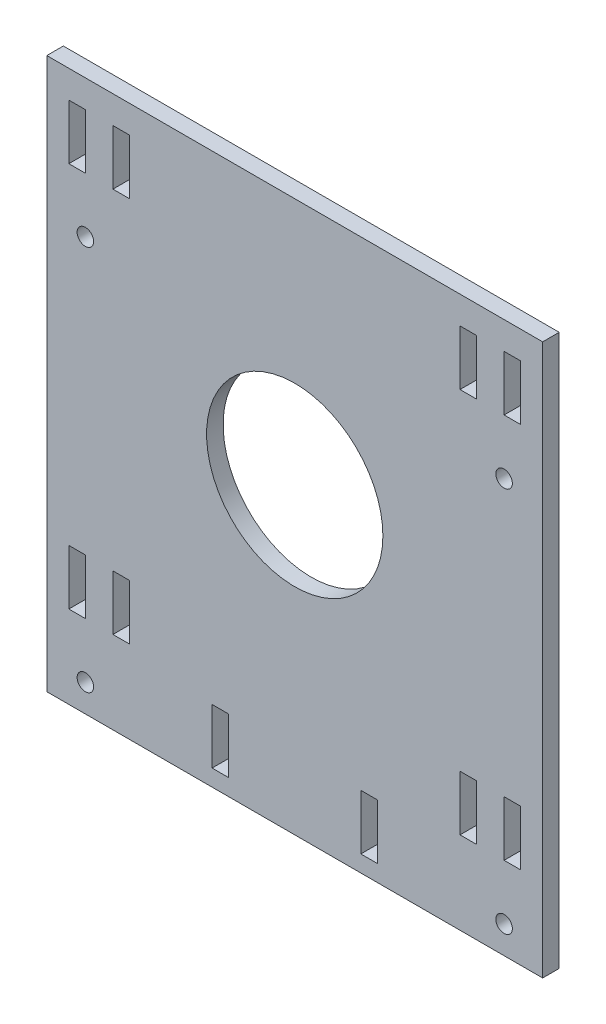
ISO-10303-21;
HEADER;
FILE_DESCRIPTION(('STEP AP214'),'2;1');
FILE_NAME('part.step','',(''),(''),'','','');
FILE_SCHEMA(('AUTOMOTIVE_DESIGN { 1 0 10303 214 1 1 1 1 }'));
ENDSEC;
DATA;
#1=APPLICATION_CONTEXT('core data for automotive mechanical design processes');
#2=APPLICATION_PROTOCOL_DEFINITION('international standard','automotive_design',2000,#1);
#3=PRODUCT_CONTEXT('',#1,'mechanical');
#4=PRODUCT('Part','Part','',(#3));
#5=PRODUCT_RELATED_PRODUCT_CATEGORY('part','',(#4));
#6=PRODUCT_DEFINITION_FORMATION('','',#4);
#7=PRODUCT_DEFINITION_CONTEXT('part definition',#1,'design');
#8=PRODUCT_DEFINITION('design','',#6,#7);
#9=PRODUCT_DEFINITION_SHAPE('','',#8);
#10=(LENGTH_UNIT() NAMED_UNIT(*) SI_UNIT(.MILLI.,.METRE.));
#11=(NAMED_UNIT(*) PLANE_ANGLE_UNIT() SI_UNIT($,.RADIAN.));
#12=(NAMED_UNIT(*) SI_UNIT($,.STERADIAN.) SOLID_ANGLE_UNIT());
#13=UNCERTAINTY_MEASURE_WITH_UNIT(LENGTH_MEASURE(1.E-05),#10,'distance_accuracy_value','');
#14=(GEOMETRIC_REPRESENTATION_CONTEXT(3) GLOBAL_UNCERTAINTY_ASSIGNED_CONTEXT((#13)) GLOBAL_UNIT_ASSIGNED_CONTEXT((#10,
#11,#12)) REPRESENTATION_CONTEXT('',''));
#15=CARTESIAN_POINT('',(0.,0.,0.));
#16=DIRECTION('',(0.,0.,1.));
#17=DIRECTION('',(1.,0.,0.));
#18=AXIS2_PLACEMENT_3D('',#15,#16,#17);
#19=CARTESIAN_POINT('',(44.9999999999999,1.2490009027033E-13,3.));
#20=DIRECTION('',(1.,0.,0.));
#21=DIRECTION('',(0.,1.,0.));
#22=AXIS2_PLACEMENT_3D('',#19,#20,#21);
#23=PLANE('',#22);
#24=DIRECTION('',(0.,-1.,0.));
#25=VECTOR('',#24,1.);
#26=CARTESIAN_POINT('',(44.9999999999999,1.2490009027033E-13,0.));
#27=LINE('',#26,#25);
#28=CARTESIAN_POINT('',(45.,45.,0.));
#29=VERTEX_POINT('',#28);
#30=CARTESIAN_POINT('',(45.,-55.,0.));
#31=VERTEX_POINT('',#30);
#32=EDGE_CURVE('E609',#29,#31,#27,.T.);
#33=ORIENTED_EDGE('',*,*,#32,.F.);
#34=DIRECTION('',(0.,0.,-1.));
#35=VECTOR('',#34,1.);
#36=CARTESIAN_POINT('',(45.,45.,3.));
#37=LINE('',#36,#35);
#38=CARTESIAN_POINT('',(45.,45.,3.));
#39=VERTEX_POINT('',#38);
#40=EDGE_CURVE('E625',#39,#29,#37,.T.);
#41=ORIENTED_EDGE('',*,*,#40,.F.);
#42=DIRECTION('',(0.,-1.,0.));
#43=VECTOR('',#42,1.);
#44=CARTESIAN_POINT('',(44.9999999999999,1.2490009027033E-13,3.));
#45=LINE('',#44,#43);
#46=CARTESIAN_POINT('',(45.,-55.,3.));
#47=VERTEX_POINT('',#46);
#48=EDGE_CURVE('E594',#39,#47,#45,.T.);
#49=ORIENTED_EDGE('',*,*,#48,.T.);
#50=DIRECTION('',(0.,0.,-1.));
#51=VECTOR('',#50,1.);
#52=CARTESIAN_POINT('',(45.,-55.,3.));
#53=LINE('',#52,#51);
#54=EDGE_CURVE('E606',#47,#31,#53,.T.);
#55=ORIENTED_EDGE('',*,*,#54,.T.);
#56=EDGE_LOOP('',(#33,#41,#49,#55));
#57=FACE_BOUND('',#56,.T.);
#58=ADVANCED_FACE('F34',(#57),#23,.T.);
#59=CARTESIAN_POINT('',(0.,45.,3.));
#60=DIRECTION('',(0.,1.,0.));
#61=DIRECTION('',(0.,0.,1.));
#62=AXIS2_PLACEMENT_3D('',#59,#60,#61);
#63=PLANE('',#62);
#64=DIRECTION('',(1.,0.,0.));
#65=VECTOR('',#64,1.);
#66=CARTESIAN_POINT('',(0.,45.,0.));
#67=LINE('',#66,#65);
#68=CARTESIAN_POINT('',(-45.,45.,0.));
#69=VERTEX_POINT('',#68);
#70=EDGE_CURVE('E612',#69,#29,#67,.T.);
#71=ORIENTED_EDGE('',*,*,#70,.F.);
#72=DIRECTION('',(0.,0.,-1.));
#73=VECTOR('',#72,1.);
#74=CARTESIAN_POINT('',(-45.,45.,3.));
#75=LINE('',#74,#73);
#76=CARTESIAN_POINT('',(-45.,45.,3.));
#77=VERTEX_POINT('',#76);
#78=EDGE_CURVE('E623',#77,#69,#75,.T.);
#79=ORIENTED_EDGE('',*,*,#78,.F.);
#80=DIRECTION('',(1.,0.,0.));
#81=VECTOR('',#80,1.);
#82=CARTESIAN_POINT('',(0.,45.,3.));
#83=LINE('',#82,#81);
#84=EDGE_CURVE('E598',#77,#39,#83,.T.);
#85=ORIENTED_EDGE('',*,*,#84,.T.);
#86=ORIENTED_EDGE('',*,*,#40,.T.);
#87=EDGE_LOOP('',(#71,#79,#85,#86));
#88=FACE_BOUND('',#87,.T.);
#89=ADVANCED_FACE('F732',(#88),#63,.T.);
#90=CARTESIAN_POINT('',(-45.,0.,3.));
#91=DIRECTION('',(-1.,0.,0.));
#92=DIRECTION('',(0.,-1.,0.));
#93=AXIS2_PLACEMENT_3D('',#90,#91,#92);
#94=PLANE('',#93);
#95=DIRECTION('',(0.,1.,0.));
#96=VECTOR('',#95,1.);
#97=CARTESIAN_POINT('',(-45.,0.,0.));
#98=LINE('',#97,#96);
#99=CARTESIAN_POINT('',(-45.,-55.,0.));
#100=VERTEX_POINT('',#99);
#101=EDGE_CURVE('E615',#100,#69,#98,.T.);
#102=ORIENTED_EDGE('',*,*,#101,.F.);
#103=DIRECTION('',(0.,0.,-1.));
#104=VECTOR('',#103,1.);
#105=CARTESIAN_POINT('',(-45.,-55.,3.));
#106=LINE('',#105,#104);
#107=CARTESIAN_POINT('',(-45.,-55.,3.));
#108=VERTEX_POINT('',#107);
#109=EDGE_CURVE('E621',#108,#100,#106,.T.);
#110=ORIENTED_EDGE('',*,*,#109,.F.);
#111=DIRECTION('',(0.,1.,0.));
#112=VECTOR('',#111,1.);
#113=CARTESIAN_POINT('',(-45.,0.,3.));
#114=LINE('',#113,#112);
#115=EDGE_CURVE('E601',#108,#77,#114,.T.);
#116=ORIENTED_EDGE('',*,*,#115,.T.);
#117=ORIENTED_EDGE('',*,*,#78,.T.);
#118=EDGE_LOOP('',(#102,#110,#116,#117));
#119=FACE_BOUND('',#118,.T.);
#120=ADVANCED_FACE('F737',(#119),#94,.T.);
#121=CARTESIAN_POINT('',(0.,0.,3.));
#122=DIRECTION('',(0.,0.,-1.));
#123=DIRECTION('',(-1.,0.,0.));
#124=AXIS2_PLACEMENT_3D('',#121,#122,#123);
#125=CYLINDRICAL_SURFACE('',#124,16.);
#126=CARTESIAN_POINT('',(0.,0.,3.));
#127=DIRECTION('',(0.,0.,1.));
#128=DIRECTION('',(1.,0.,0.));
#129=AXIS2_PLACEMENT_3D('',#126,#127,#128);
#130=CIRCLE('',#129,16.);
#131=CARTESIAN_POINT('',(16.,0.,3.));
#132=VERTEX_POINT('',#131);
#133=EDGE_CURVE('E591',#132,#132,#130,.T.);
#134=ORIENTED_EDGE('',*,*,#133,.T.);
#135=EDGE_LOOP('',(#134));
#136=FACE_BOUND('',#135,.T.);
#137=CARTESIAN_POINT('',(0.,0.,0.));
#138=DIRECTION('',(0.,0.,1.));
#139=DIRECTION('',(1.,0.,0.));
#140=AXIS2_PLACEMENT_3D('',#137,#138,#139);
#141=CIRCLE('',#140,16.);
#142=CARTESIAN_POINT('',(16.,0.,0.));
#143=VERTEX_POINT('',#142);
#144=EDGE_CURVE('E584',#143,#143,#141,.T.);
#145=ORIENTED_EDGE('',*,*,#144,.F.);
#146=EDGE_LOOP('',(#145));
#147=FACE_BOUND('',#146,.T.);
#148=ADVANCED_FACE('F36',(#136,#147),#125,.F.);
#149=CARTESIAN_POINT('',(0.,-55.,3.));
#150=DIRECTION('',(0.,1.,0.));
#151=DIRECTION('',(0.,0.,1.));
#152=AXIS2_PLACEMENT_3D('',#149,#150,#151);
#153=PLANE('',#152);
#154=DIRECTION('',(1.,0.,0.));
#155=VECTOR('',#154,1.);
#156=CARTESIAN_POINT('',(0.,-55.,0.));
#157=LINE('',#156,#155);
#158=EDGE_CURVE('E595',#100,#31,#157,.T.);
#159=ORIENTED_EDGE('',*,*,#158,.T.);
#160=ORIENTED_EDGE('',*,*,#54,.F.);
#161=DIRECTION('',(1.,0.,0.));
#162=VECTOR('',#161,1.);
#163=CARTESIAN_POINT('',(0.,-55.,3.));
#164=LINE('',#163,#162);
#165=EDGE_CURVE('E604',#108,#47,#164,.T.);
#166=ORIENTED_EDGE('',*,*,#165,.F.);
#167=ORIENTED_EDGE('',*,*,#109,.T.);
#168=EDGE_LOOP('',(#159,#160,#166,#167));
#169=FACE_BOUND('',#168,.T.);
#170=ADVANCED_FACE('F745',(#169),#153,.F.);
#171=CARTESIAN_POINT('',(0.,0.,3.));
#172=DIRECTION('',(0.,0.,1.));
#173=DIRECTION('',(1.,0.,0.));
#174=AXIS2_PLACEMENT_3D('',#171,#172,#173);
#175=PLANE('',#174);
#176=DIRECTION('',(-1.,0.,0.));
#177=VECTOR('',#176,1.);
#178=CARTESIAN_POINT('',(-15.,-42.,3.));
#179=LINE('',#178,#177);
#180=CARTESIAN_POINT('',(-12.,-42.,3.));
#181=VERTEX_POINT('',#180);
#182=CARTESIAN_POINT('',(-15.,-42.,3.));
#183=VERTEX_POINT('',#182);
#184=EDGE_CURVE('E49',#181,#183,#179,.T.);
#185=ORIENTED_EDGE('',*,*,#184,.F.);
#186=DIRECTION('',(0.,1.,0.));
#187=VECTOR('',#186,1.);
#188=CARTESIAN_POINT('',(-12.,-52.,3.));
#189=LINE('',#188,#187);
#190=CARTESIAN_POINT('',(-12.,-52.,3.));
#191=VERTEX_POINT('',#190);
#192=EDGE_CURVE('E366',#191,#181,#189,.T.);
#193=ORIENTED_EDGE('',*,*,#192,.F.);
#194=DIRECTION('',(1.,0.,0.));
#195=VECTOR('',#194,1.);
#196=CARTESIAN_POINT('',(-15.,-52.,3.));
#197=LINE('',#196,#195);
#198=CARTESIAN_POINT('',(-15.,-52.,3.));
#199=VERTEX_POINT('',#198);
#200=EDGE_CURVE('E363',#199,#191,#197,.T.);
#201=ORIENTED_EDGE('',*,*,#200,.F.);
#202=DIRECTION('',(0.,-1.,0.));
#203=VECTOR('',#202,1.);
#204=CARTESIAN_POINT('',(-15.,-42.,3.));
#205=LINE('',#204,#203);
#206=EDGE_CURVE('E359',#183,#199,#205,.T.);
#207=ORIENTED_EDGE('',*,*,#206,.F.);
#208=EDGE_LOOP('',(#185,#193,#201,#207));
#209=FACE_BOUND('',#208,.T.);
#210=CARTESIAN_POINT('',(-38.,20.,3.));
#211=DIRECTION('',(0.,0.,1.));
#212=DIRECTION('',(1.,0.,0.));
#213=AXIS2_PLACEMENT_3D('',#210,#211,#212);
#214=CIRCLE('',#213,1.5);
#215=CARTESIAN_POINT('',(-36.5,20.,3.));
#216=VERTEX_POINT('',#215);
#217=EDGE_CURVE('E353',#216,#216,#214,.T.);
#218=ORIENTED_EDGE('',*,*,#217,.F.);
#219=EDGE_LOOP('',(#218));
#220=FACE_BOUND('',#219,.T.);
#221=CARTESIAN_POINT('',(-38.,-50.,3.));
#222=DIRECTION('',(0.,0.,1.));
#223=DIRECTION('',(1.,0.,0.));
#224=AXIS2_PLACEMENT_3D('',#221,#222,#223);
#225=CIRCLE('',#224,1.5);
#226=CARTESIAN_POINT('',(-36.5,-50.,3.));
#227=VERTEX_POINT('',#226);
#228=EDGE_CURVE('E356',#227,#227,#225,.T.);
#229=ORIENTED_EDGE('',*,*,#228,.F.);
#230=EDGE_LOOP('',(#229));
#231=FACE_BOUND('',#230,.T.);
#232=DIRECTION('',(0.,1.,0.));
#233=VECTOR('',#232,1.);
#234=CARTESIAN_POINT('',(-38.,30.,3.));
#235=LINE('',#234,#233);
#236=CARTESIAN_POINT('',(-38.,30.,3.));
#237=VERTEX_POINT('',#236);
#238=CARTESIAN_POINT('',(-38.,40.,3.));
#239=VERTEX_POINT('',#238);
#240=EDGE_CURVE('E57',#237,#239,#235,.T.);
#241=ORIENTED_EDGE('',*,*,#240,.F.);
#242=DIRECTION('',(1.,0.,0.));
#243=VECTOR('',#242,1.);
#244=CARTESIAN_POINT('',(-41.,30.,3.));
#245=LINE('',#244,#243);
#246=CARTESIAN_POINT('',(-41.,30.,3.));
#247=VERTEX_POINT('',#246);
#248=EDGE_CURVE('E383',#247,#237,#245,.T.);
#249=ORIENTED_EDGE('',*,*,#248,.F.);
#250=DIRECTION('',(0.,-1.,0.));
#251=VECTOR('',#250,1.);
#252=CARTESIAN_POINT('',(-41.,40.,3.));
#253=LINE('',#252,#251);
#254=CARTESIAN_POINT('',(-41.,40.,3.));
#255=VERTEX_POINT('',#254);
#256=EDGE_CURVE('E380',#255,#247,#253,.T.);
#257=ORIENTED_EDGE('',*,*,#256,.F.);
#258=DIRECTION('',(-1.,0.,0.));
#259=VECTOR('',#258,1.);
#260=CARTESIAN_POINT('',(-38.,40.,3.));
#261=LINE('',#260,#259);
#262=EDGE_CURVE('E377',#239,#255,#261,.T.);
#263=ORIENTED_EDGE('',*,*,#262,.F.);
#264=EDGE_LOOP('',(#241,#249,#257,#263));
#265=FACE_BOUND('',#264,.T.);
#266=DIRECTION('',(0.,-1.,0.));
#267=VECTOR('',#266,1.);
#268=CARTESIAN_POINT('',(38.,30.,3.));
#269=LINE('',#268,#267);
#270=CARTESIAN_POINT('',(38.,40.,3.));
#271=VERTEX_POINT('',#270);
#272=CARTESIAN_POINT('',(38.,30.,3.));
#273=VERTEX_POINT('',#272);
#274=EDGE_CURVE('E350',#271,#273,#269,.T.);
#275=ORIENTED_EDGE('',*,*,#274,.F.);
#276=DIRECTION('',(-1.,0.,0.));
#277=VECTOR('',#276,1.);
#278=CARTESIAN_POINT('',(38.,40.,3.));
#279=LINE('',#278,#277);
#280=CARTESIAN_POINT('',(41.,40.,3.));
#281=VERTEX_POINT('',#280);
#282=EDGE_CURVE('E426',#281,#271,#279,.T.);
#283=ORIENTED_EDGE('',*,*,#282,.F.);
#284=DIRECTION('',(0.,1.,0.));
#285=VECTOR('',#284,1.);
#286=CARTESIAN_POINT('',(41.,40.,3.));
#287=LINE('',#286,#285);
#288=CARTESIAN_POINT('',(41.,30.,3.));
#289=VERTEX_POINT('',#288);
#290=EDGE_CURVE('E423',#289,#281,#287,.T.);
#291=ORIENTED_EDGE('',*,*,#290,.F.);
#292=DIRECTION('',(1.,0.,0.));
#293=VECTOR('',#292,1.);
#294=CARTESIAN_POINT('',(41.,30.,3.));
#295=LINE('',#294,#293);
#296=EDGE_CURVE('E420',#273,#289,#295,.T.);
#297=ORIENTED_EDGE('',*,*,#296,.F.);
#298=EDGE_LOOP('',(#275,#283,#291,#297));
#299=FACE_BOUND('',#298,.T.);
#300=DIRECTION('',(0.,1.,0.));
#301=VECTOR('',#300,1.);
#302=CARTESIAN_POINT('',(15.,-42.,3.));
#303=LINE('',#302,#301);
#304=CARTESIAN_POINT('',(15.,-52.,3.));
#305=VERTEX_POINT('',#304);
#306=CARTESIAN_POINT('',(15.,-42.,3.));
#307=VERTEX_POINT('',#306);
#308=EDGE_CURVE('E397',#305,#307,#303,.T.);
#309=ORIENTED_EDGE('',*,*,#308,.F.);
#310=DIRECTION('',(1.,0.,0.));
#311=VECTOR('',#310,1.);
#312=CARTESIAN_POINT('',(15.,-52.,3.));
#313=LINE('',#312,#311);
#314=CARTESIAN_POINT('',(12.,-52.,3.));
#315=VERTEX_POINT('',#314);
#316=EDGE_CURVE('E406',#315,#305,#313,.T.);
#317=ORIENTED_EDGE('',*,*,#316,.F.);
#318=DIRECTION('',(0.,-1.,0.));
#319=VECTOR('',#318,1.);
#320=CARTESIAN_POINT('',(12.,-52.,3.));
#321=LINE('',#320,#319);
#322=CARTESIAN_POINT('',(12.,-42.,3.));
#323=VERTEX_POINT('',#322);
#324=EDGE_CURVE('E403',#323,#315,#321,.T.);
#325=ORIENTED_EDGE('',*,*,#324,.F.);
#326=DIRECTION('',(-1.,0.,0.));
#327=VECTOR('',#326,1.);
#328=CARTESIAN_POINT('',(15.,-42.,3.));
#329=LINE('',#328,#327);
#330=EDGE_CURVE('E399',#307,#323,#329,.T.);
#331=ORIENTED_EDGE('',*,*,#330,.F.);
#332=EDGE_LOOP('',(#309,#317,#325,#331));
#333=FACE_BOUND('',#332,.T.);
#334=CARTESIAN_POINT('',(38.,-50.,3.));
#335=DIRECTION('',(0.,0.,1.));
#336=DIRECTION('',(-1.,0.,0.));
#337=AXIS2_PLACEMENT_3D('',#334,#335,#336);
#338=CIRCLE('',#337,1.5);
#339=CARTESIAN_POINT('',(36.5,-50.,3.));
#340=VERTEX_POINT('',#339);
#341=EDGE_CURVE('E412',#340,#340,#338,.T.);
#342=ORIENTED_EDGE('',*,*,#341,.F.);
#343=EDGE_LOOP('',(#342));
#344=FACE_BOUND('',#343,.T.);
#345=CARTESIAN_POINT('',(38.,20.,3.));
#346=DIRECTION('',(0.,0.,1.));
#347=DIRECTION('',(-1.,0.,0.));
#348=AXIS2_PLACEMENT_3D('',#345,#346,#347);
#349=CIRCLE('',#348,1.5);
#350=CARTESIAN_POINT('',(36.5,20.,3.));
#351=VERTEX_POINT('',#350);
#352=EDGE_CURVE('E360',#351,#351,#349,.T.);
#353=ORIENTED_EDGE('',*,*,#352,.F.);
#354=EDGE_LOOP('',(#353));
#355=FACE_BOUND('',#354,.T.);
#356=DIRECTION('',(0.,1.,0.));
#357=VECTOR('',#356,1.);
#358=CARTESIAN_POINT('',(41.,-40.,3.));
#359=LINE('',#358,#357);
#360=CARTESIAN_POINT('',(41.,-40.,3.));
#361=VERTEX_POINT('',#360);
#362=CARTESIAN_POINT('',(41.,-30.,3.));
#363=VERTEX_POINT('',#362);
#364=EDGE_CURVE('E338',#361,#363,#359,.T.);
#365=ORIENTED_EDGE('',*,*,#364,.F.);
#366=DIRECTION('',(1.,0.,0.));
#367=VECTOR('',#366,1.);
#368=CARTESIAN_POINT('',(38.,-40.,3.));
#369=LINE('',#368,#367);
#370=CARTESIAN_POINT('',(38.,-40.,3.));
#371=VERTEX_POINT('',#370);
#372=EDGE_CURVE('E343',#371,#361,#369,.T.);
#373=ORIENTED_EDGE('',*,*,#372,.F.);
#374=DIRECTION('',(0.,-1.,0.));
#375=VECTOR('',#374,1.);
#376=CARTESIAN_POINT('',(38.,-30.,3.));
#377=LINE('',#376,#375);
#378=CARTESIAN_POINT('',(38.,-30.,3.));
#379=VERTEX_POINT('',#378);
#380=EDGE_CURVE('E322',#379,#371,#377,.T.);
#381=ORIENTED_EDGE('',*,*,#380,.F.);
#382=DIRECTION('',(-1.,0.,0.));
#383=VECTOR('',#382,1.);
#384=CARTESIAN_POINT('',(41.,-30.,3.));
#385=LINE('',#384,#383);
#386=EDGE_CURVE('E333',#363,#379,#385,.T.);
#387=ORIENTED_EDGE('',*,*,#386,.F.);
#388=EDGE_LOOP('',(#365,#373,#381,#387));
#389=FACE_BOUND('',#388,.T.);
#390=DIRECTION('',(-1.,0.,0.));
#391=VECTOR('',#390,1.);
#392=CARTESIAN_POINT('',(-41.,-30.,3.));
#393=LINE('',#392,#391);
#394=CARTESIAN_POINT('',(-38.,-30.,3.));
#395=VERTEX_POINT('',#394);
#396=CARTESIAN_POINT('',(-41.,-30.,3.));
#397=VERTEX_POINT('',#396);
#398=EDGE_CURVE('E389',#395,#397,#393,.T.);
#399=ORIENTED_EDGE('',*,*,#398,.F.);
#400=DIRECTION('',(0.,1.,0.));
#401=VECTOR('',#400,1.);
#402=CARTESIAN_POINT('',(-38.,-30.,3.));
#403=LINE('',#402,#401);
#404=CARTESIAN_POINT('',(-38.,-40.,3.));
#405=VERTEX_POINT('',#404);
#406=EDGE_CURVE('E448',#405,#395,#403,.T.);
#407=ORIENTED_EDGE('',*,*,#406,.F.);
#408=DIRECTION('',(1.,0.,0.));
#409=VECTOR('',#408,1.);
#410=CARTESIAN_POINT('',(-38.,-40.,3.));
#411=LINE('',#410,#409);
#412=CARTESIAN_POINT('',(-41.,-40.,3.));
#413=VERTEX_POINT('',#412);
#414=EDGE_CURVE('E445',#413,#405,#411,.T.);
#415=ORIENTED_EDGE('',*,*,#414,.F.);
#416=DIRECTION('',(0.,-1.,0.));
#417=VECTOR('',#416,1.);
#418=CARTESIAN_POINT('',(-41.,-40.,3.));
#419=LINE('',#418,#417);
#420=EDGE_CURVE('E442',#397,#413,#419,.T.);
#421=ORIENTED_EDGE('',*,*,#420,.F.);
#422=EDGE_LOOP('',(#399,#407,#415,#421));
#423=FACE_BOUND('',#422,.T.);
#424=DIRECTION('',(-1.,0.,0.));
#425=VECTOR('',#424,1.);
#426=CARTESIAN_POINT('',(33.,40.,3.));
#427=LINE('',#426,#425);
#428=CARTESIAN_POINT('',(33.,40.,3.));
#429=VERTEX_POINT('',#428);
#430=CARTESIAN_POINT('',(30.,40.,3.));
#431=VERTEX_POINT('',#430);
#432=EDGE_CURVE('E509',#429,#431,#427,.T.);
#433=ORIENTED_EDGE('',*,*,#432,.F.);
#434=DIRECTION('',(0.,1.,0.));
#435=VECTOR('',#434,1.);
#436=CARTESIAN_POINT('',(33.,30.,3.));
#437=LINE('',#436,#435);
#438=CARTESIAN_POINT('',(33.,30.,3.));
#439=VERTEX_POINT('',#438);
#440=EDGE_CURVE('E499',#439,#429,#437,.T.);
#441=ORIENTED_EDGE('',*,*,#440,.F.);
#442=DIRECTION('',(1.,0.,0.));
#443=VECTOR('',#442,1.);
#444=CARTESIAN_POINT('',(30.,30.,3.));
#445=LINE('',#444,#443);
#446=CARTESIAN_POINT('',(30.,30.,3.));
#447=VERTEX_POINT('',#446);
#448=EDGE_CURVE('E515',#447,#439,#445,.T.);
#449=ORIENTED_EDGE('',*,*,#448,.F.);
#450=DIRECTION('',(0.,-1.,0.));
#451=VECTOR('',#450,1.);
#452=CARTESIAN_POINT('',(30.,40.,3.));
#453=LINE('',#452,#451);
#454=EDGE_CURVE('E511',#431,#447,#453,.T.);
#455=ORIENTED_EDGE('',*,*,#454,.F.);
#456=EDGE_LOOP('',(#433,#441,#449,#455));
#457=FACE_BOUND('',#456,.T.);
#458=DIRECTION('',(-1.,0.,0.));
#459=VECTOR('',#458,1.);
#460=CARTESIAN_POINT('',(-30.,-30.,3.));
#461=LINE('',#460,#459);
#462=CARTESIAN_POINT('',(-30.,-30.,3.));
#463=VERTEX_POINT('',#462);
#464=CARTESIAN_POINT('',(-33.,-30.,3.));
#465=VERTEX_POINT('',#464);
#466=EDGE_CURVE('E488',#463,#465,#461,.T.);
#467=ORIENTED_EDGE('',*,*,#466,.F.);
#468=DIRECTION('',(0.,1.,0.));
#469=VECTOR('',#468,1.);
#470=CARTESIAN_POINT('',(-30.,-40.,3.));
#471=LINE('',#470,#469);
#472=CARTESIAN_POINT('',(-30.,-40.,3.));
#473=VERTEX_POINT('',#472);
#474=EDGE_CURVE('E533',#473,#463,#471,.T.);
#475=ORIENTED_EDGE('',*,*,#474,.F.);
#476=DIRECTION('',(1.,0.,0.));
#477=VECTOR('',#476,1.);
#478=CARTESIAN_POINT('',(-33.,-40.,3.));
#479=LINE('',#478,#477);
#480=CARTESIAN_POINT('',(-33.,-40.,3.));
#481=VERTEX_POINT('',#480);
#482=EDGE_CURVE('E547',#481,#473,#479,.T.);
#483=ORIENTED_EDGE('',*,*,#482,.F.);
#484=DIRECTION('',(0.,-1.,0.));
#485=VECTOR('',#484,1.);
#486=CARTESIAN_POINT('',(-33.,-30.,3.));
#487=LINE('',#486,#485);
#488=EDGE_CURVE('E544',#465,#481,#487,.T.);
#489=ORIENTED_EDGE('',*,*,#488,.F.);
#490=EDGE_LOOP('',(#467,#475,#483,#489));
#491=FACE_BOUND('',#490,.T.);
#492=DIRECTION('',(-1.,0.,0.));
#493=VECTOR('',#492,1.);
#494=CARTESIAN_POINT('',(33.,-30.,3.));
#495=LINE('',#494,#493);
#496=CARTESIAN_POINT('',(33.,-30.,3.));
#497=VERTEX_POINT('',#496);
#498=CARTESIAN_POINT('',(30.,-30.,3.));
#499=VERTEX_POINT('',#498);
#500=EDGE_CURVE('E475',#497,#499,#495,.T.);
#501=ORIENTED_EDGE('',*,*,#500,.F.);
#502=DIRECTION('',(0.,1.,0.));
#503=VECTOR('',#502,1.);
#504=CARTESIAN_POINT('',(33.,-40.,3.));
#505=LINE('',#504,#503);
#506=CARTESIAN_POINT('',(33.,-40.,3.));
#507=VERTEX_POINT('',#506);
#508=EDGE_CURVE('E465',#507,#497,#505,.T.);
#509=ORIENTED_EDGE('',*,*,#508,.F.);
#510=DIRECTION('',(1.,0.,0.));
#511=VECTOR('',#510,1.);
#512=CARTESIAN_POINT('',(30.,-40.,3.));
#513=LINE('',#512,#511);
#514=CARTESIAN_POINT('',(30.,-40.,3.));
#515=VERTEX_POINT('',#514);
#516=EDGE_CURVE('E481',#515,#507,#513,.T.);
#517=ORIENTED_EDGE('',*,*,#516,.F.);
#518=DIRECTION('',(0.,-1.,0.));
#519=VECTOR('',#518,1.);
#520=CARTESIAN_POINT('',(30.,-30.,3.));
#521=LINE('',#520,#519);
#522=EDGE_CURVE('E477',#499,#515,#521,.T.);
#523=ORIENTED_EDGE('',*,*,#522,.F.);
#524=EDGE_LOOP('',(#501,#509,#517,#523));
#525=FACE_BOUND('',#524,.T.);
#526=DIRECTION('',(-1.,0.,0.));
#527=VECTOR('',#526,1.);
#528=CARTESIAN_POINT('',(-30.,40.,3.));
#529=LINE('',#528,#527);
#530=CARTESIAN_POINT('',(-30.,40.,3.));
#531=VERTEX_POINT('',#530);
#532=CARTESIAN_POINT('',(-33.,40.,3.));
#533=VERTEX_POINT('',#532);
#534=EDGE_CURVE('E522',#531,#533,#529,.T.);
#535=ORIENTED_EDGE('',*,*,#534,.F.);
#536=DIRECTION('',(0.,1.,0.));
#537=VECTOR('',#536,1.);
#538=CARTESIAN_POINT('',(-30.,30.,3.));
#539=LINE('',#538,#537);
#540=CARTESIAN_POINT('',(-30.,30.,3.));
#541=VERTEX_POINT('',#540);
#542=EDGE_CURVE('E563',#541,#531,#539,.T.);
#543=ORIENTED_EDGE('',*,*,#542,.F.);
#544=DIRECTION('',(1.,0.,0.));
#545=VECTOR('',#544,1.);
#546=CARTESIAN_POINT('',(-33.,30.,3.));
#547=LINE('',#546,#545);
#548=CARTESIAN_POINT('',(-33.,30.,3.));
#549=VERTEX_POINT('',#548);
#550=EDGE_CURVE('E577',#549,#541,#547,.T.);
#551=ORIENTED_EDGE('',*,*,#550,.F.);
#552=DIRECTION('',(0.,-1.,0.));
#553=VECTOR('',#552,1.);
#554=CARTESIAN_POINT('',(-33.,40.,3.));
#555=LINE('',#554,#553);
#556=EDGE_CURVE('E574',#533,#549,#555,.T.);
#557=ORIENTED_EDGE('',*,*,#556,.F.);
#558=EDGE_LOOP('',(#535,#543,#551,#557));
#559=FACE_BOUND('',#558,.T.);
#560=ORIENTED_EDGE('',*,*,#133,.F.);
#561=EDGE_LOOP('',(#560));
#562=FACE_BOUND('',#561,.T.);
#563=ORIENTED_EDGE('',*,*,#48,.F.);
#564=ORIENTED_EDGE('',*,*,#84,.F.);
#565=ORIENTED_EDGE('',*,*,#115,.F.);
#566=ORIENTED_EDGE('',*,*,#165,.T.);
#567=EDGE_LOOP('',(#563,#564,#565,#566));
#568=FACE_BOUND('',#567,.T.);
#569=ADVANCED_FACE('F340',(#209,#220,#231,#265,#299,#333,#344,#355,#389,#423,#457,#491,#525,
#559,#562,#568),#175,.T.);
#570=CARTESIAN_POINT('',(0.,0.,0.));
#571=DIRECTION('',(0.,0.,1.));
#572=DIRECTION('',(1.,0.,0.));
#573=AXIS2_PLACEMENT_3D('',#570,#571,#572);
#574=PLANE('',#573);
#575=DIRECTION('',(0.,1.,0.));
#576=VECTOR('',#575,1.);
#577=CARTESIAN_POINT('',(-12.,0.,0.));
#578=LINE('',#577,#576);
#579=CARTESIAN_POINT('',(-12.,-52.,0.));
#580=VERTEX_POINT('',#579);
#581=CARTESIAN_POINT('',(-12.,-42.,0.));
#582=VERTEX_POINT('',#581);
#583=EDGE_CURVE('E42',#580,#582,#578,.T.);
#584=ORIENTED_EDGE('',*,*,#583,.T.);
#585=DIRECTION('',(-1.,0.,0.));
#586=VECTOR('',#585,1.);
#587=CARTESIAN_POINT('',(0.,-42.,0.));
#588=LINE('',#587,#586);
#589=CARTESIAN_POINT('',(-15.,-42.,0.));
#590=VERTEX_POINT('',#589);
#591=EDGE_CURVE('E11',#582,#590,#588,.T.);
#592=ORIENTED_EDGE('',*,*,#591,.T.);
#593=DIRECTION('',(0.,-1.,0.));
#594=VECTOR('',#593,1.);
#595=CARTESIAN_POINT('',(-15.,0.,0.));
#596=LINE('',#595,#594);
#597=CARTESIAN_POINT('',(-15.,-52.,0.));
#598=VERTEX_POINT('',#597);
#599=EDGE_CURVE('E690',#590,#598,#596,.T.);
#600=ORIENTED_EDGE('',*,*,#599,.T.);
#601=DIRECTION('',(1.,0.,0.));
#602=VECTOR('',#601,1.);
#603=CARTESIAN_POINT('',(0.,-52.,0.));
#604=LINE('',#603,#602);
#605=EDGE_CURVE('E697',#598,#580,#604,.T.);
#606=ORIENTED_EDGE('',*,*,#605,.T.);
#607=EDGE_LOOP('',(#584,#592,#600,#606));
#608=FACE_BOUND('',#607,.T.);
#609=CARTESIAN_POINT('',(-38.,20.,0.));
#610=DIRECTION('',(0.,0.,1.));
#611=DIRECTION('',(1.,0.,0.));
#612=AXIS2_PLACEMENT_3D('',#609,#610,#611);
#613=CIRCLE('',#612,1.5);
#614=CARTESIAN_POINT('',(-36.5,20.,0.));
#615=VERTEX_POINT('',#614);
#616=EDGE_CURVE('E478',#615,#615,#613,.T.);
#617=ORIENTED_EDGE('',*,*,#616,.T.);
#618=EDGE_LOOP('',(#617));
#619=FACE_BOUND('',#618,.T.);
#620=CARTESIAN_POINT('',(-38.,-50.,0.));
#621=DIRECTION('',(0.,0.,1.));
#622=DIRECTION('',(1.,0.,0.));
#623=AXIS2_PLACEMENT_3D('',#620,#621,#622);
#624=CIRCLE('',#623,1.5);
#625=CARTESIAN_POINT('',(-36.5,-50.,0.));
#626=VERTEX_POINT('',#625);
#627=EDGE_CURVE('E654',#626,#626,#624,.T.);
#628=ORIENTED_EDGE('',*,*,#627,.T.);
#629=EDGE_LOOP('',(#628));
#630=FACE_BOUND('',#629,.T.);
#631=DIRECTION('',(1.,0.,0.));
#632=VECTOR('',#631,1.);
#633=CARTESIAN_POINT('',(0.,30.,0.));
#634=LINE('',#633,#632);
#635=CARTESIAN_POINT('',(-41.,30.,0.));
#636=VERTEX_POINT('',#635);
#637=CARTESIAN_POINT('',(-38.,30.,0.));
#638=VERTEX_POINT('',#637);
#639=EDGE_CURVE('E684',#636,#638,#634,.T.);
#640=ORIENTED_EDGE('',*,*,#639,.T.);
#641=DIRECTION('',(0.,1.,0.));
#642=VECTOR('',#641,1.);
#643=CARTESIAN_POINT('',(-38.,0.,0.));
#644=LINE('',#643,#642);
#645=CARTESIAN_POINT('',(-38.,40.,0.));
#646=VERTEX_POINT('',#645);
#647=EDGE_CURVE('E687',#638,#646,#644,.T.);
#648=ORIENTED_EDGE('',*,*,#647,.T.);
#649=DIRECTION('',(-1.,0.,0.));
#650=VECTOR('',#649,1.);
#651=CARTESIAN_POINT('',(0.,40.,0.));
#652=LINE('',#651,#650);
#653=CARTESIAN_POINT('',(-41.,40.,0.));
#654=VERTEX_POINT('',#653);
#655=EDGE_CURVE('E678',#646,#654,#652,.T.);
#656=ORIENTED_EDGE('',*,*,#655,.T.);
#657=DIRECTION('',(0.,-1.,0.));
#658=VECTOR('',#657,1.);
#659=CARTESIAN_POINT('',(-41.,0.,0.));
#660=LINE('',#659,#658);
#661=EDGE_CURVE('E681',#654,#636,#660,.T.);
#662=ORIENTED_EDGE('',*,*,#661,.T.);
#663=EDGE_LOOP('',(#640,#648,#656,#662));
#664=FACE_BOUND('',#663,.T.);
#665=DIRECTION('',(-1.,0.,0.));
#666=VECTOR('',#665,1.);
#667=CARTESIAN_POINT('',(0.,40.,0.));
#668=LINE('',#667,#666);
#669=CARTESIAN_POINT('',(41.,40.,0.));
#670=VERTEX_POINT('',#669);
#671=CARTESIAN_POINT('',(38.,40.,0.));
#672=VERTEX_POINT('',#671);
#673=EDGE_CURVE('E672',#670,#672,#668,.T.);
#674=ORIENTED_EDGE('',*,*,#673,.T.);
#675=DIRECTION('',(0.,-1.,0.));
#676=VECTOR('',#675,1.);
#677=CARTESIAN_POINT('',(38.,0.,0.));
#678=LINE('',#677,#676);
#679=CARTESIAN_POINT('',(38.,30.,0.));
#680=VERTEX_POINT('',#679);
#681=EDGE_CURVE('E675',#672,#680,#678,.T.);
#682=ORIENTED_EDGE('',*,*,#681,.T.);
#683=DIRECTION('',(1.,0.,0.));
#684=VECTOR('',#683,1.);
#685=CARTESIAN_POINT('',(0.,30.,0.));
#686=LINE('',#685,#684);
#687=CARTESIAN_POINT('',(41.,30.,0.));
#688=VERTEX_POINT('',#687);
#689=EDGE_CURVE('E666',#680,#688,#686,.T.);
#690=ORIENTED_EDGE('',*,*,#689,.T.);
#691=DIRECTION('',(0.,1.,0.));
#692=VECTOR('',#691,1.);
#693=CARTESIAN_POINT('',(41.,0.,0.));
#694=LINE('',#693,#692);
#695=EDGE_CURVE('E669',#688,#670,#694,.T.);
#696=ORIENTED_EDGE('',*,*,#695,.T.);
#697=EDGE_LOOP('',(#674,#682,#690,#696));
#698=FACE_BOUND('',#697,.T.);
#699=DIRECTION('',(1.,0.,0.));
#700=VECTOR('',#699,1.);
#701=CARTESIAN_POINT('',(0.,-52.,0.));
#702=LINE('',#701,#700);
#703=CARTESIAN_POINT('',(12.,-52.,0.));
#704=VERTEX_POINT('',#703);
#705=CARTESIAN_POINT('',(15.,-52.,0.));
#706=VERTEX_POINT('',#705);
#707=EDGE_CURVE('E660',#704,#706,#702,.T.);
#708=ORIENTED_EDGE('',*,*,#707,.T.);
#709=DIRECTION('',(0.,1.,0.));
#710=VECTOR('',#709,1.);
#711=CARTESIAN_POINT('',(15.,0.,0.));
#712=LINE('',#711,#710);
#713=CARTESIAN_POINT('',(15.,-42.,0.));
#714=VERTEX_POINT('',#713);
#715=EDGE_CURVE('E663',#706,#714,#712,.T.);
#716=ORIENTED_EDGE('',*,*,#715,.T.);
#717=DIRECTION('',(-1.,0.,0.));
#718=VECTOR('',#717,1.);
#719=CARTESIAN_POINT('',(0.,-42.,0.));
#720=LINE('',#719,#718);
#721=CARTESIAN_POINT('',(12.,-42.,0.));
#722=VERTEX_POINT('',#721);
#723=EDGE_CURVE('E648',#714,#722,#720,.T.);
#724=ORIENTED_EDGE('',*,*,#723,.T.);
#725=DIRECTION('',(0.,-1.,0.));
#726=VECTOR('',#725,1.);
#727=CARTESIAN_POINT('',(12.,0.,0.));
#728=LINE('',#727,#726);
#729=EDGE_CURVE('E657',#722,#704,#728,.T.);
#730=ORIENTED_EDGE('',*,*,#729,.T.);
#731=EDGE_LOOP('',(#708,#716,#724,#730));
#732=FACE_BOUND('',#731,.T.);
#733=CARTESIAN_POINT('',(38.,-50.,0.));
#734=DIRECTION('',(0.,0.,1.));
#735=DIRECTION('',(1.,0.,0.));
#736=AXIS2_PLACEMENT_3D('',#733,#734,#735);
#737=CIRCLE('',#736,1.5);
#738=CARTESIAN_POINT('',(39.5,-50.,0.));
#739=VERTEX_POINT('',#738);
#740=EDGE_CURVE('E651',#739,#739,#737,.T.);
#741=ORIENTED_EDGE('',*,*,#740,.T.);
#742=EDGE_LOOP('',(#741));
#743=FACE_BOUND('',#742,.T.);
#744=CARTESIAN_POINT('',(38.,20.,0.));
#745=DIRECTION('',(0.,0.,1.));
#746=DIRECTION('',(1.,0.,0.));
#747=AXIS2_PLACEMENT_3D('',#744,#745,#746);
#748=CIRCLE('',#747,1.5);
#749=CARTESIAN_POINT('',(39.5,20.,0.));
#750=VERTEX_POINT('',#749);
#751=EDGE_CURVE('E454',#750,#750,#748,.T.);
#752=ORIENTED_EDGE('',*,*,#751,.T.);
#753=EDGE_LOOP('',(#752));
#754=FACE_BOUND('',#753,.T.);
#755=DIRECTION('',(1.,0.,0.));
#756=VECTOR('',#755,1.);
#757=CARTESIAN_POINT('',(0.,-40.,0.));
#758=LINE('',#757,#756);
#759=CARTESIAN_POINT('',(38.,-40.,0.));
#760=VERTEX_POINT('',#759);
#761=CARTESIAN_POINT('',(41.,-40.,0.));
#762=VERTEX_POINT('',#761);
#763=EDGE_CURVE('E642',#760,#762,#758,.T.);
#764=ORIENTED_EDGE('',*,*,#763,.T.);
#765=DIRECTION('',(0.,1.,0.));
#766=VECTOR('',#765,1.);
#767=CARTESIAN_POINT('',(40.9999999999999,0.,0.));
#768=LINE('',#767,#766);
#769=CARTESIAN_POINT('',(41.,-30.,0.));
#770=VERTEX_POINT('',#769);
#771=EDGE_CURVE('E645',#762,#770,#768,.T.);
#772=ORIENTED_EDGE('',*,*,#771,.T.);
#773=DIRECTION('',(-1.,0.,0.));
#774=VECTOR('',#773,1.);
#775=CARTESIAN_POINT('',(0.,-30.,0.));
#776=LINE('',#775,#774);
#777=CARTESIAN_POINT('',(38.,-30.,0.));
#778=VERTEX_POINT('',#777);
#779=EDGE_CURVE('E639',#770,#778,#776,.T.);
#780=ORIENTED_EDGE('',*,*,#779,.T.);
#781=DIRECTION('',(0.,-1.,0.));
#782=VECTOR('',#781,1.);
#783=CARTESIAN_POINT('',(37.9999999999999,0.,0.));
#784=LINE('',#783,#782);
#785=EDGE_CURVE('E325',#778,#760,#784,.T.);
#786=ORIENTED_EDGE('',*,*,#785,.T.);
#787=EDGE_LOOP('',(#764,#772,#780,#786));
#788=FACE_BOUND('',#787,.T.);
#789=DIRECTION('',(0.,1.,0.));
#790=VECTOR('',#789,1.);
#791=CARTESIAN_POINT('',(-38.,0.,0.));
#792=LINE('',#791,#790);
#793=CARTESIAN_POINT('',(-38.,-40.,0.));
#794=VERTEX_POINT('',#793);
#795=CARTESIAN_POINT('',(-38.,-30.,0.));
#796=VERTEX_POINT('',#795);
#797=EDGE_CURVE('E633',#794,#796,#792,.T.);
#798=ORIENTED_EDGE('',*,*,#797,.T.);
#799=DIRECTION('',(-1.,0.,0.));
#800=VECTOR('',#799,1.);
#801=CARTESIAN_POINT('',(0.,-30.,0.));
#802=LINE('',#801,#800);
#803=CARTESIAN_POINT('',(-41.,-30.,0.));
#804=VERTEX_POINT('',#803);
#805=EDGE_CURVE('E636',#796,#804,#802,.T.);
#806=ORIENTED_EDGE('',*,*,#805,.T.);
#807=DIRECTION('',(0.,-1.,0.));
#808=VECTOR('',#807,1.);
#809=CARTESIAN_POINT('',(-41.,0.,0.));
#810=LINE('',#809,#808);
#811=CARTESIAN_POINT('',(-41.,-40.,0.));
#812=VERTEX_POINT('',#811);
#813=EDGE_CURVE('E627',#804,#812,#810,.T.);
#814=ORIENTED_EDGE('',*,*,#813,.T.);
#815=DIRECTION('',(1.,0.,0.));
#816=VECTOR('',#815,1.);
#817=CARTESIAN_POINT('',(0.,-40.,0.));
#818=LINE('',#817,#816);
#819=EDGE_CURVE('E630',#812,#794,#818,.T.);
#820=ORIENTED_EDGE('',*,*,#819,.T.);
#821=EDGE_LOOP('',(#798,#806,#814,#820));
#822=FACE_BOUND('',#821,.T.);
#823=DIRECTION('',(0.,1.,0.));
#824=VECTOR('',#823,1.);
#825=CARTESIAN_POINT('',(33.,30.,0.));
#826=LINE('',#825,#824);
#827=CARTESIAN_POINT('',(33.,30.,0.));
#828=VERTEX_POINT('',#827);
#829=CARTESIAN_POINT('',(33.,40.,0.));
#830=VERTEX_POINT('',#829);
#831=EDGE_CURVE('E505',#828,#830,#826,.T.);
#832=ORIENTED_EDGE('',*,*,#831,.T.);
#833=DIRECTION('',(-1.,0.,0.));
#834=VECTOR('',#833,1.);
#835=CARTESIAN_POINT('',(33.,40.,0.));
#836=LINE('',#835,#834);
#837=CARTESIAN_POINT('',(30.,40.,0.));
#838=VERTEX_POINT('',#837);
#839=EDGE_CURVE('E495',#830,#838,#836,.T.);
#840=ORIENTED_EDGE('',*,*,#839,.T.);
#841=DIRECTION('',(0.,-1.,0.));
#842=VECTOR('',#841,1.);
#843=CARTESIAN_POINT('',(30.,40.,0.));
#844=LINE('',#843,#842);
#845=CARTESIAN_POINT('',(30.,30.,0.));
#846=VERTEX_POINT('',#845);
#847=EDGE_CURVE('E498',#838,#846,#844,.T.);
#848=ORIENTED_EDGE('',*,*,#847,.T.);
#849=DIRECTION('',(1.,0.,0.));
#850=VECTOR('',#849,1.);
#851=CARTESIAN_POINT('',(30.,30.,0.));
#852=LINE('',#851,#850);
#853=EDGE_CURVE('E502',#846,#828,#852,.T.);
#854=ORIENTED_EDGE('',*,*,#853,.T.);
#855=EDGE_LOOP('',(#832,#840,#848,#854));
#856=FACE_BOUND('',#855,.T.);
#857=DIRECTION('',(0.,1.,0.));
#858=VECTOR('',#857,1.);
#859=CARTESIAN_POINT('',(-30.,-40.,0.));
#860=LINE('',#859,#858);
#861=CARTESIAN_POINT('',(-30.,-40.,0.));
#862=VERTEX_POINT('',#861);
#863=CARTESIAN_POINT('',(-30.,-30.,0.));
#864=VERTEX_POINT('',#863);
#865=EDGE_CURVE('E539',#862,#864,#860,.T.);
#866=ORIENTED_EDGE('',*,*,#865,.T.);
#867=DIRECTION('',(-1.,0.,0.));
#868=VECTOR('',#867,1.);
#869=CARTESIAN_POINT('',(-30.,-30.,0.));
#870=LINE('',#869,#868);
#871=CARTESIAN_POINT('',(-33.,-30.,0.));
#872=VERTEX_POINT('',#871);
#873=EDGE_CURVE('E529',#864,#872,#870,.T.);
#874=ORIENTED_EDGE('',*,*,#873,.T.);
#875=DIRECTION('',(0.,-1.,0.));
#876=VECTOR('',#875,1.);
#877=CARTESIAN_POINT('',(-33.,-30.,0.));
#878=LINE('',#877,#876);
#879=CARTESIAN_POINT('',(-33.,-40.,0.));
#880=VERTEX_POINT('',#879);
#881=EDGE_CURVE('E532',#872,#880,#878,.T.);
#882=ORIENTED_EDGE('',*,*,#881,.T.);
#883=DIRECTION('',(1.,0.,0.));
#884=VECTOR('',#883,1.);
#885=CARTESIAN_POINT('',(-33.,-40.,0.));
#886=LINE('',#885,#884);
#887=EDGE_CURVE('E536',#880,#862,#886,.T.);
#888=ORIENTED_EDGE('',*,*,#887,.T.);
#889=EDGE_LOOP('',(#866,#874,#882,#888));
#890=FACE_BOUND('',#889,.T.);
#891=DIRECTION('',(0.,1.,0.));
#892=VECTOR('',#891,1.);
#893=CARTESIAN_POINT('',(33.,-40.,0.));
#894=LINE('',#893,#892);
#895=CARTESIAN_POINT('',(33.,-40.,0.));
#896=VERTEX_POINT('',#895);
#897=CARTESIAN_POINT('',(33.,-30.,0.));
#898=VERTEX_POINT('',#897);
#899=EDGE_CURVE('E471',#896,#898,#894,.T.);
#900=ORIENTED_EDGE('',*,*,#899,.T.);
#901=DIRECTION('',(-1.,0.,0.));
#902=VECTOR('',#901,1.);
#903=CARTESIAN_POINT('',(33.,-30.,0.));
#904=LINE('',#903,#902);
#905=CARTESIAN_POINT('',(30.,-30.,0.));
#906=VERTEX_POINT('',#905);
#907=EDGE_CURVE('E461',#898,#906,#904,.T.);
#908=ORIENTED_EDGE('',*,*,#907,.T.);
#909=DIRECTION('',(0.,-1.,0.));
#910=VECTOR('',#909,1.);
#911=CARTESIAN_POINT('',(30.,-30.,0.));
#912=LINE('',#911,#910);
#913=CARTESIAN_POINT('',(30.,-40.,0.));
#914=VERTEX_POINT('',#913);
#915=EDGE_CURVE('E464',#906,#914,#912,.T.);
#916=ORIENTED_EDGE('',*,*,#915,.T.);
#917=DIRECTION('',(1.,0.,0.));
#918=VECTOR('',#917,1.);
#919=CARTESIAN_POINT('',(30.,-40.,0.));
#920=LINE('',#919,#918);
#921=EDGE_CURVE('E468',#914,#896,#920,.T.);
#922=ORIENTED_EDGE('',*,*,#921,.T.);
#923=EDGE_LOOP('',(#900,#908,#916,#922));
#924=FACE_BOUND('',#923,.T.);
#925=DIRECTION('',(0.,1.,0.));
#926=VECTOR('',#925,1.);
#927=CARTESIAN_POINT('',(-30.,30.,0.));
#928=LINE('',#927,#926);
#929=CARTESIAN_POINT('',(-30.,30.,0.));
#930=VERTEX_POINT('',#929);
#931=CARTESIAN_POINT('',(-30.,40.,0.));
#932=VERTEX_POINT('',#931);
#933=EDGE_CURVE('E569',#930,#932,#928,.T.);
#934=ORIENTED_EDGE('',*,*,#933,.T.);
#935=DIRECTION('',(-1.,0.,0.));
#936=VECTOR('',#935,1.);
#937=CARTESIAN_POINT('',(-30.,40.,0.));
#938=LINE('',#937,#936);
#939=CARTESIAN_POINT('',(-33.,40.,0.));
#940=VERTEX_POINT('',#939);
#941=EDGE_CURVE('E559',#932,#940,#938,.T.);
#942=ORIENTED_EDGE('',*,*,#941,.T.);
#943=DIRECTION('',(0.,-1.,0.));
#944=VECTOR('',#943,1.);
#945=CARTESIAN_POINT('',(-33.,40.,0.));
#946=LINE('',#945,#944);
#947=CARTESIAN_POINT('',(-33.,30.,0.));
#948=VERTEX_POINT('',#947);
#949=EDGE_CURVE('E562',#940,#948,#946,.T.);
#950=ORIENTED_EDGE('',*,*,#949,.T.);
#951=DIRECTION('',(1.,0.,0.));
#952=VECTOR('',#951,1.);
#953=CARTESIAN_POINT('',(-33.,30.,0.));
#954=LINE('',#953,#952);
#955=EDGE_CURVE('E566',#948,#930,#954,.T.);
#956=ORIENTED_EDGE('',*,*,#955,.T.);
#957=EDGE_LOOP('',(#934,#942,#950,#956));
#958=FACE_BOUND('',#957,.T.);
#959=ORIENTED_EDGE('',*,*,#144,.T.);
#960=EDGE_LOOP('',(#959));
#961=FACE_BOUND('',#960,.T.);
#962=ORIENTED_EDGE('',*,*,#32,.T.);
#963=ORIENTED_EDGE('',*,*,#158,.F.);
#964=ORIENTED_EDGE('',*,*,#101,.T.);
#965=ORIENTED_EDGE('',*,*,#70,.T.);
#966=EDGE_LOOP('',(#962,#963,#964,#965));
#967=FACE_BOUND('',#966,.T.);
#968=ADVANCED_FACE('F701',(#608,#619,#630,#664,#698,#732,#743,#754,#788,#822,#856,#890,#924,
#958,#961,#967),#574,.F.);
#969=CARTESIAN_POINT('',(-30.,40.,0.));
#970=DIRECTION('',(0.,1.,0.));
#971=DIRECTION('',(0.,0.,1.));
#972=AXIS2_PLACEMENT_3D('',#969,#970,#971);
#973=PLANE('',#972);
#974=ORIENTED_EDGE('',*,*,#534,.T.);
#975=DIRECTION('',(0.,0.,1.));
#976=VECTOR('',#975,1.);
#977=CARTESIAN_POINT('',(-33.,40.,0.));
#978=LINE('',#977,#976);
#979=EDGE_CURVE('E572',#940,#533,#978,.T.);
#980=ORIENTED_EDGE('',*,*,#979,.F.);
#981=ORIENTED_EDGE('',*,*,#941,.F.);
#982=DIRECTION('',(0.,0.,1.));
#983=VECTOR('',#982,1.);
#984=CARTESIAN_POINT('',(-30.,40.,0.));
#985=LINE('',#984,#983);
#986=EDGE_CURVE('E582',#932,#531,#985,.T.);
#987=ORIENTED_EDGE('',*,*,#986,.T.);
#988=EDGE_LOOP('',(#974,#980,#981,#987));
#989=FACE_BOUND('',#988,.T.);
#990=ADVANCED_FACE('F751',(#989),#973,.F.);
#991=CARTESIAN_POINT('',(-30.,30.,0.));
#992=DIRECTION('',(1.,0.,0.));
#993=DIRECTION('',(0.,0.,-1.));
#994=AXIS2_PLACEMENT_3D('',#991,#992,#993);
#995=PLANE('',#994);
#996=ORIENTED_EDGE('',*,*,#542,.T.);
#997=ORIENTED_EDGE('',*,*,#986,.F.);
#998=ORIENTED_EDGE('',*,*,#933,.F.);
#999=DIRECTION('',(0.,0.,1.));
#1000=VECTOR('',#999,1.);
#1001=CARTESIAN_POINT('',(-30.,30.,0.));
#1002=LINE('',#1001,#1000);
#1003=EDGE_CURVE('E585',#930,#541,#1002,.T.);
#1004=ORIENTED_EDGE('',*,*,#1003,.T.);
#1005=EDGE_LOOP('',(#996,#997,#998,#1004));
#1006=FACE_BOUND('',#1005,.T.);
#1007=ADVANCED_FACE('F756',(#1006),#995,.F.);
#1008=CARTESIAN_POINT('',(-33.,30.,0.));
#1009=DIRECTION('',(0.,-1.,0.));
#1010=DIRECTION('',(0.,0.,-1.));
#1011=AXIS2_PLACEMENT_3D('',#1008,#1009,#1010);
#1012=PLANE('',#1011);
#1013=ORIENTED_EDGE('',*,*,#550,.T.);
#1014=ORIENTED_EDGE('',*,*,#1003,.F.);
#1015=ORIENTED_EDGE('',*,*,#955,.F.);
#1016=DIRECTION('',(0.,0.,1.));
#1017=VECTOR('',#1016,1.);
#1018=CARTESIAN_POINT('',(-33.,30.,0.));
#1019=LINE('',#1018,#1017);
#1020=EDGE_CURVE('E587',#948,#549,#1019,.T.);
#1021=ORIENTED_EDGE('',*,*,#1020,.T.);
#1022=EDGE_LOOP('',(#1013,#1014,#1015,#1021));
#1023=FACE_BOUND('',#1022,.T.);
#1024=ADVANCED_FACE('F762',(#1023),#1012,.F.);
#1025=CARTESIAN_POINT('',(-33.,40.,0.));
#1026=DIRECTION('',(-1.,0.,0.));
#1027=DIRECTION('',(0.,0.,1.));
#1028=AXIS2_PLACEMENT_3D('',#1025,#1026,#1027);
#1029=PLANE('',#1028);
#1030=ORIENTED_EDGE('',*,*,#556,.T.);
#1031=ORIENTED_EDGE('',*,*,#1020,.F.);
#1032=ORIENTED_EDGE('',*,*,#949,.F.);
#1033=ORIENTED_EDGE('',*,*,#979,.T.);
#1034=EDGE_LOOP('',(#1030,#1031,#1032,#1033));
#1035=FACE_BOUND('',#1034,.T.);
#1036=ADVANCED_FACE('F758',(#1035),#1029,.F.);
#1037=CARTESIAN_POINT('',(33.,-30.,0.));
#1038=DIRECTION('',(0.,1.,0.));
#1039=DIRECTION('',(0.,0.,1.));
#1040=AXIS2_PLACEMENT_3D('',#1037,#1038,#1039);
#1041=PLANE('',#1040);
#1042=ORIENTED_EDGE('',*,*,#500,.T.);
#1043=DIRECTION('',(0.,0.,1.));
#1044=VECTOR('',#1043,1.);
#1045=CARTESIAN_POINT('',(30.,-30.,0.));
#1046=LINE('',#1045,#1044);
#1047=EDGE_CURVE('E474',#906,#499,#1046,.T.);
#1048=ORIENTED_EDGE('',*,*,#1047,.F.);
#1049=ORIENTED_EDGE('',*,*,#907,.F.);
#1050=DIRECTION('',(0.,0.,1.));
#1051=VECTOR('',#1050,1.);
#1052=CARTESIAN_POINT('',(33.,-30.,0.));
#1053=LINE('',#1052,#1051);
#1054=EDGE_CURVE('E486',#898,#497,#1053,.T.);
#1055=ORIENTED_EDGE('',*,*,#1054,.T.);
#1056=EDGE_LOOP('',(#1042,#1048,#1049,#1055));
#1057=FACE_BOUND('',#1056,.T.);
#1058=ADVANCED_FACE('F761',(#1057),#1041,.F.);
#1059=CARTESIAN_POINT('',(33.,-40.,0.));
#1060=DIRECTION('',(1.,0.,0.));
#1061=DIRECTION('',(0.,0.,-1.));
#1062=AXIS2_PLACEMENT_3D('',#1059,#1060,#1061);
#1063=PLANE('',#1062);
#1064=ORIENTED_EDGE('',*,*,#508,.T.);
#1065=ORIENTED_EDGE('',*,*,#1054,.F.);
#1066=ORIENTED_EDGE('',*,*,#899,.F.);
#1067=DIRECTION('',(0.,0.,1.));
#1068=VECTOR('',#1067,1.);
#1069=CARTESIAN_POINT('',(33.,-40.,0.));
#1070=LINE('',#1069,#1068);
#1071=EDGE_CURVE('E489',#896,#507,#1070,.T.);
#1072=ORIENTED_EDGE('',*,*,#1071,.T.);
#1073=EDGE_LOOP('',(#1064,#1065,#1066,#1072));
#1074=FACE_BOUND('',#1073,.T.);
#1075=ADVANCED_FACE('F806',(#1074),#1063,.F.);
#1076=CARTESIAN_POINT('',(30.,-40.,0.));
#1077=DIRECTION('',(0.,-1.,0.));
#1078=DIRECTION('',(1.,0.,0.));
#1079=AXIS2_PLACEMENT_3D('',#1076,#1077,#1078);
#1080=PLANE('',#1079);
#1081=ORIENTED_EDGE('',*,*,#516,.T.);
#1082=ORIENTED_EDGE('',*,*,#1071,.F.);
#1083=ORIENTED_EDGE('',*,*,#921,.F.);
#1084=DIRECTION('',(0.,0.,1.));
#1085=VECTOR('',#1084,1.);
#1086=CARTESIAN_POINT('',(30.,-40.,0.));
#1087=LINE('',#1086,#1085);
#1088=EDGE_CURVE('E491',#914,#515,#1087,.T.);
#1089=ORIENTED_EDGE('',*,*,#1088,.T.);
#1090=EDGE_LOOP('',(#1081,#1082,#1083,#1089));
#1091=FACE_BOUND('',#1090,.T.);
#1092=ADVANCED_FACE('F810',(#1091),#1080,.F.);
#1093=CARTESIAN_POINT('',(30.,-30.,0.));
#1094=DIRECTION('',(-1.,0.,0.));
#1095=DIRECTION('',(0.,0.,1.));
#1096=AXIS2_PLACEMENT_3D('',#1093,#1094,#1095);
#1097=PLANE('',#1096);
#1098=ORIENTED_EDGE('',*,*,#522,.T.);
#1099=ORIENTED_EDGE('',*,*,#1088,.F.);
#1100=ORIENTED_EDGE('',*,*,#915,.F.);
#1101=ORIENTED_EDGE('',*,*,#1047,.T.);
#1102=EDGE_LOOP('',(#1098,#1099,#1100,#1101));
#1103=FACE_BOUND('',#1102,.T.);
#1104=ADVANCED_FACE('F774',(#1103),#1097,.F.);
#1105=CARTESIAN_POINT('',(-30.,-30.,0.));
#1106=DIRECTION('',(0.,1.,0.));
#1107=DIRECTION('',(-1.,0.,0.));
#1108=AXIS2_PLACEMENT_3D('',#1105,#1106,#1107);
#1109=PLANE('',#1108);
#1110=ORIENTED_EDGE('',*,*,#466,.T.);
#1111=DIRECTION('',(0.,0.,1.));
#1112=VECTOR('',#1111,1.);
#1113=CARTESIAN_POINT('',(-33.,-30.,0.));
#1114=LINE('',#1113,#1112);
#1115=EDGE_CURVE('E542',#872,#465,#1114,.T.);
#1116=ORIENTED_EDGE('',*,*,#1115,.F.);
#1117=ORIENTED_EDGE('',*,*,#873,.F.);
#1118=DIRECTION('',(0.,0.,1.));
#1119=VECTOR('',#1118,1.);
#1120=CARTESIAN_POINT('',(-30.,-30.,0.));
#1121=LINE('',#1120,#1119);
#1122=EDGE_CURVE('E512',#864,#463,#1121,.T.);
#1123=ORIENTED_EDGE('',*,*,#1122,.T.);
#1124=EDGE_LOOP('',(#1110,#1116,#1117,#1123));
#1125=FACE_BOUND('',#1124,.T.);
#1126=ADVANCED_FACE('F770',(#1125),#1109,.F.);
#1127=CARTESIAN_POINT('',(-30.,-40.,0.));
#1128=DIRECTION('',(1.,0.,0.));
#1129=DIRECTION('',(0.,1.,0.));
#1130=AXIS2_PLACEMENT_3D('',#1127,#1128,#1129);
#1131=PLANE('',#1130);
#1132=ORIENTED_EDGE('',*,*,#474,.T.);
#1133=ORIENTED_EDGE('',*,*,#1122,.F.);
#1134=ORIENTED_EDGE('',*,*,#865,.F.);
#1135=DIRECTION('',(0.,0.,1.));
#1136=VECTOR('',#1135,1.);
#1137=CARTESIAN_POINT('',(-30.,-40.,0.));
#1138=LINE('',#1137,#1136);
#1139=EDGE_CURVE('E553',#862,#473,#1138,.T.);
#1140=ORIENTED_EDGE('',*,*,#1139,.T.);
#1141=EDGE_LOOP('',(#1132,#1133,#1134,#1140));
#1142=FACE_BOUND('',#1141,.T.);
#1143=ADVANCED_FACE('F773',(#1142),#1131,.F.);
#1144=CARTESIAN_POINT('',(-33.,-40.,0.));
#1145=DIRECTION('',(0.,-1.,0.));
#1146=DIRECTION('',(0.,0.,-1.));
#1147=AXIS2_PLACEMENT_3D('',#1144,#1145,#1146);
#1148=PLANE('',#1147);
#1149=ORIENTED_EDGE('',*,*,#482,.T.);
#1150=ORIENTED_EDGE('',*,*,#1139,.F.);
#1151=ORIENTED_EDGE('',*,*,#887,.F.);
#1152=DIRECTION('',(0.,0.,1.));
#1153=VECTOR('',#1152,1.);
#1154=CARTESIAN_POINT('',(-33.,-40.,0.));
#1155=LINE('',#1154,#1153);
#1156=EDGE_CURVE('E555',#880,#481,#1155,.T.);
#1157=ORIENTED_EDGE('',*,*,#1156,.T.);
#1158=EDGE_LOOP('',(#1149,#1150,#1151,#1157));
#1159=FACE_BOUND('',#1158,.T.);
#1160=ADVANCED_FACE('F780',(#1159),#1148,.F.);
#1161=CARTESIAN_POINT('',(-33.,-30.,0.));
#1162=DIRECTION('',(-1.,0.,0.));
#1163=DIRECTION('',(0.,-1.,0.));
#1164=AXIS2_PLACEMENT_3D('',#1161,#1162,#1163);
#1165=PLANE('',#1164);
#1166=ORIENTED_EDGE('',*,*,#488,.T.);
#1167=ORIENTED_EDGE('',*,*,#1156,.F.);
#1168=ORIENTED_EDGE('',*,*,#881,.F.);
#1169=ORIENTED_EDGE('',*,*,#1115,.T.);
#1170=EDGE_LOOP('',(#1166,#1167,#1168,#1169));
#1171=FACE_BOUND('',#1170,.T.);
#1172=ADVANCED_FACE('F776',(#1171),#1165,.F.);
#1173=CARTESIAN_POINT('',(33.,40.,0.));
#1174=DIRECTION('',(0.,1.,0.));
#1175=DIRECTION('',(0.,0.,1.));
#1176=AXIS2_PLACEMENT_3D('',#1173,#1174,#1175);
#1177=PLANE('',#1176);
#1178=ORIENTED_EDGE('',*,*,#432,.T.);
#1179=DIRECTION('',(0.,0.,1.));
#1180=VECTOR('',#1179,1.);
#1181=CARTESIAN_POINT('',(30.,40.,0.));
#1182=LINE('',#1181,#1180);
#1183=EDGE_CURVE('E508',#838,#431,#1182,.T.);
#1184=ORIENTED_EDGE('',*,*,#1183,.F.);
#1185=ORIENTED_EDGE('',*,*,#839,.F.);
#1186=DIRECTION('',(0.,0.,1.));
#1187=VECTOR('',#1186,1.);
#1188=CARTESIAN_POINT('',(33.,40.,0.));
#1189=LINE('',#1188,#1187);
#1190=EDGE_CURVE('E520',#830,#429,#1189,.T.);
#1191=ORIENTED_EDGE('',*,*,#1190,.T.);
#1192=EDGE_LOOP('',(#1178,#1184,#1185,#1191));
#1193=FACE_BOUND('',#1192,.T.);
#1194=ADVANCED_FACE('F779',(#1193),#1177,.F.);
#1195=CARTESIAN_POINT('',(33.,30.,0.));
#1196=DIRECTION('',(1.,0.,0.));
#1197=DIRECTION('',(0.,0.,-1.));
#1198=AXIS2_PLACEMENT_3D('',#1195,#1196,#1197);
#1199=PLANE('',#1198);
#1200=ORIENTED_EDGE('',*,*,#440,.T.);
#1201=ORIENTED_EDGE('',*,*,#1190,.F.);
#1202=ORIENTED_EDGE('',*,*,#831,.F.);
#1203=DIRECTION('',(0.,0.,1.));
#1204=VECTOR('',#1203,1.);
#1205=CARTESIAN_POINT('',(33.,30.,0.));
#1206=LINE('',#1205,#1204);
#1207=EDGE_CURVE('E523',#828,#439,#1206,.T.);
#1208=ORIENTED_EDGE('',*,*,#1207,.T.);
#1209=EDGE_LOOP('',(#1200,#1201,#1202,#1208));
#1210=FACE_BOUND('',#1209,.T.);
#1211=ADVANCED_FACE('F790',(#1210),#1199,.F.);
#1212=CARTESIAN_POINT('',(30.,30.,0.));
#1213=DIRECTION('',(0.,-1.,0.));
#1214=DIRECTION('',(0.,0.,-1.));
#1215=AXIS2_PLACEMENT_3D('',#1212,#1213,#1214);
#1216=PLANE('',#1215);
#1217=ORIENTED_EDGE('',*,*,#448,.T.);
#1218=ORIENTED_EDGE('',*,*,#1207,.F.);
#1219=ORIENTED_EDGE('',*,*,#853,.F.);
#1220=DIRECTION('',(0.,0.,1.));
#1221=VECTOR('',#1220,1.);
#1222=CARTESIAN_POINT('',(30.,30.,0.));
#1223=LINE('',#1222,#1221);
#1224=EDGE_CURVE('E525',#846,#447,#1223,.T.);
#1225=ORIENTED_EDGE('',*,*,#1224,.T.);
#1226=EDGE_LOOP('',(#1217,#1218,#1219,#1225));
#1227=FACE_BOUND('',#1226,.T.);
#1228=ADVANCED_FACE('F796',(#1227),#1216,.F.);
#1229=CARTESIAN_POINT('',(30.,40.,0.));
#1230=DIRECTION('',(-1.,0.,0.));
#1231=DIRECTION('',(0.,-1.,0.));
#1232=AXIS2_PLACEMENT_3D('',#1229,#1230,#1231);
#1233=PLANE('',#1232);
#1234=ORIENTED_EDGE('',*,*,#454,.T.);
#1235=ORIENTED_EDGE('',*,*,#1224,.F.);
#1236=ORIENTED_EDGE('',*,*,#847,.F.);
#1237=ORIENTED_EDGE('',*,*,#1183,.T.);
#1238=EDGE_LOOP('',(#1234,#1235,#1236,#1237));
#1239=FACE_BOUND('',#1238,.T.);
#1240=ADVANCED_FACE('F792',(#1239),#1233,.F.);
#1241=CARTESIAN_POINT('',(-41.,-30.,-7.));
#1242=DIRECTION('',(0.,1.,0.));
#1243=DIRECTION('',(0.,0.,1.));
#1244=AXIS2_PLACEMENT_3D('',#1241,#1242,#1243);
#1245=PLANE('',#1244);
#1246=DIRECTION('',(0.,0.,1.));
#1247=VECTOR('',#1246,1.);
#1248=CARTESIAN_POINT('',(-38.,-30.,-7.));
#1249=LINE('',#1248,#1247);
#1250=EDGE_CURVE('E452',#796,#395,#1249,.T.);
#1251=ORIENTED_EDGE('',*,*,#1250,.T.);
#1252=ORIENTED_EDGE('',*,*,#398,.T.);
#1253=DIRECTION('',(0.,0.,1.));
#1254=VECTOR('',#1253,1.);
#1255=CARTESIAN_POINT('',(-41.,-30.,-7.));
#1256=LINE('',#1255,#1254);
#1257=EDGE_CURVE('E451',#804,#397,#1256,.T.);
#1258=ORIENTED_EDGE('',*,*,#1257,.F.);
#1259=ORIENTED_EDGE('',*,*,#805,.F.);
#1260=EDGE_LOOP('',(#1251,#1252,#1258,#1259));
#1261=FACE_BOUND('',#1260,.T.);
#1262=ADVANCED_FACE('F795',(#1261),#1245,.F.);
#1263=CARTESIAN_POINT('',(-38.,-30.,-7.));
#1264=DIRECTION('',(1.,0.,0.));
#1265=DIRECTION('',(0.,0.,-1.));
#1266=AXIS2_PLACEMENT_3D('',#1263,#1264,#1265);
#1267=PLANE('',#1266);
#1268=DIRECTION('',(0.,0.,1.));
#1269=VECTOR('',#1268,1.);
#1270=CARTESIAN_POINT('',(-38.,-40.,-7.));
#1271=LINE('',#1270,#1269);
#1272=EDGE_CURVE('E455',#794,#405,#1271,.T.);
#1273=ORIENTED_EDGE('',*,*,#1272,.T.);
#1274=ORIENTED_EDGE('',*,*,#406,.T.);
#1275=ORIENTED_EDGE('',*,*,#1250,.F.);
#1276=ORIENTED_EDGE('',*,*,#797,.F.);
#1277=EDGE_LOOP('',(#1273,#1274,#1275,#1276));
#1278=FACE_BOUND('',#1277,.T.);
#1279=ADVANCED_FACE('F820',(#1278),#1267,.F.);
#1280=CARTESIAN_POINT('',(-38.,-40.,-7.));
#1281=DIRECTION('',(0.,-1.,0.));
#1282=DIRECTION('',(0.,0.,-1.));
#1283=AXIS2_PLACEMENT_3D('',#1280,#1281,#1282);
#1284=PLANE('',#1283);
#1285=DIRECTION('',(0.,0.,1.));
#1286=VECTOR('',#1285,1.);
#1287=CARTESIAN_POINT('',(-41.,-40.,-7.));
#1288=LINE('',#1287,#1286);
#1289=EDGE_CURVE('E457',#812,#413,#1288,.T.);
#1290=ORIENTED_EDGE('',*,*,#1289,.T.);
#1291=ORIENTED_EDGE('',*,*,#414,.T.);
#1292=ORIENTED_EDGE('',*,*,#1272,.F.);
#1293=ORIENTED_EDGE('',*,*,#819,.F.);
#1294=EDGE_LOOP('',(#1290,#1291,#1292,#1293));
#1295=FACE_BOUND('',#1294,.T.);
#1296=ADVANCED_FACE('F826',(#1295),#1284,.F.);
#1297=CARTESIAN_POINT('',(-41.,-40.,-7.));
#1298=DIRECTION('',(-1.,0.,0.));
#1299=DIRECTION('',(0.,0.,1.));
#1300=AXIS2_PLACEMENT_3D('',#1297,#1298,#1299);
#1301=PLANE('',#1300);
#1302=ORIENTED_EDGE('',*,*,#1257,.T.);
#1303=ORIENTED_EDGE('',*,*,#420,.T.);
#1304=ORIENTED_EDGE('',*,*,#1289,.F.);
#1305=ORIENTED_EDGE('',*,*,#813,.F.);
#1306=EDGE_LOOP('',(#1302,#1303,#1304,#1305));
#1307=FACE_BOUND('',#1306,.T.);
#1308=ADVANCED_FACE('F822',(#1307),#1301,.F.);
#1309=CARTESIAN_POINT('',(41.,-40.,-7.));
#1310=DIRECTION('',(1.,0.,0.));
#1311=DIRECTION('',(0.,1.,0.));
#1312=AXIS2_PLACEMENT_3D('',#1309,#1310,#1311);
#1313=PLANE('',#1312);
#1314=DIRECTION('',(0.,0.,1.));
#1315=VECTOR('',#1314,1.);
#1316=CARTESIAN_POINT('',(41.,-40.,-7.));
#1317=LINE('',#1316,#1315);
#1318=EDGE_CURVE('E348',#762,#361,#1317,.T.);
#1319=ORIENTED_EDGE('',*,*,#1318,.T.);
#1320=ORIENTED_EDGE('',*,*,#364,.T.);
#1321=DIRECTION('',(0.,0.,1.));
#1322=VECTOR('',#1321,1.);
#1323=CARTESIAN_POINT('',(41.,-30.,-7.));
#1324=LINE('',#1323,#1322);
#1325=EDGE_CURVE('E329',#770,#363,#1324,.T.);
#1326=ORIENTED_EDGE('',*,*,#1325,.F.);
#1327=ORIENTED_EDGE('',*,*,#771,.F.);
#1328=EDGE_LOOP('',(#1319,#1320,#1326,#1327));
#1329=FACE_BOUND('',#1328,.T.);
#1330=ADVANCED_FACE('F825',(#1329),#1313,.F.);
#1331=CARTESIAN_POINT('',(38.,-40.,-7.));
#1332=DIRECTION('',(0.,-1.,0.));
#1333=DIRECTION('',(0.,0.,-1.));
#1334=AXIS2_PLACEMENT_3D('',#1331,#1332,#1333);
#1335=PLANE('',#1334);
#1336=DIRECTION('',(0.,0.,1.));
#1337=VECTOR('',#1336,1.);
#1338=CARTESIAN_POINT('',(38.,-40.,-7.));
#1339=LINE('',#1338,#1337);
#1340=EDGE_CURVE('E328',#760,#371,#1339,.T.);
#1341=ORIENTED_EDGE('',*,*,#1340,.T.);
#1342=ORIENTED_EDGE('',*,*,#372,.T.);
#1343=ORIENTED_EDGE('',*,*,#1318,.F.);
#1344=ORIENTED_EDGE('',*,*,#763,.F.);
#1345=EDGE_LOOP('',(#1341,#1342,#1343,#1344));
#1346=FACE_BOUND('',#1345,.T.);
#1347=ADVANCED_FACE('F1036',(#1346),#1335,.F.);
#1348=CARTESIAN_POINT('',(38.,-30.,-7.));
#1349=DIRECTION('',(-1.,0.,0.));
#1350=DIRECTION('',(0.,-1.,0.));
#1351=AXIS2_PLACEMENT_3D('',#1348,#1349,#1350);
#1352=PLANE('',#1351);
#1353=DIRECTION('',(0.,0.,1.));
#1354=VECTOR('',#1353,1.);
#1355=CARTESIAN_POINT('',(38.,-30.,-7.));
#1356=LINE('',#1355,#1354);
#1357=EDGE_CURVE('E317',#778,#379,#1356,.T.);
#1358=ORIENTED_EDGE('',*,*,#1357,.T.);
#1359=ORIENTED_EDGE('',*,*,#380,.T.);
#1360=ORIENTED_EDGE('',*,*,#1340,.F.);
#1361=ORIENTED_EDGE('',*,*,#785,.F.);
#1362=EDGE_LOOP('',(#1358,#1359,#1360,#1361));
#1363=FACE_BOUND('',#1362,.T.);
#1364=ADVANCED_FACE('F319',(#1363),#1352,.F.);
#1365=CARTESIAN_POINT('',(41.,-30.,-7.));
#1366=DIRECTION('',(0.,1.,0.));
#1367=DIRECTION('',(0.,0.,1.));
#1368=AXIS2_PLACEMENT_3D('',#1365,#1366,#1367);
#1369=PLANE('',#1368);
#1370=ORIENTED_EDGE('',*,*,#1325,.T.);
#1371=ORIENTED_EDGE('',*,*,#386,.T.);
#1372=ORIENTED_EDGE('',*,*,#1357,.F.);
#1373=ORIENTED_EDGE('',*,*,#779,.F.);
#1374=EDGE_LOOP('',(#1370,#1371,#1372,#1373));
#1375=FACE_BOUND('',#1374,.T.);
#1376=ADVANCED_FACE('F334',(#1375),#1369,.F.);
#1377=CARTESIAN_POINT('',(38.,20.,-7.));
#1378=DIRECTION('',(0.,0.,1.));
#1379=DIRECTION('',(1.,0.,0.));
#1380=AXIS2_PLACEMENT_3D('',#1377,#1378,#1379);
#1381=CYLINDRICAL_SURFACE('',#1380,1.5);
#1382=ORIENTED_EDGE('',*,*,#352,.T.);
#1383=EDGE_LOOP('',(#1382));
#1384=FACE_BOUND('',#1383,.T.);
#1385=ORIENTED_EDGE('',*,*,#751,.F.);
#1386=EDGE_LOOP('',(#1385));
#1387=FACE_BOUND('',#1386,.T.);
#1388=ADVANCED_FACE('F838',(#1384,#1387),#1381,.F.);
#1389=CARTESIAN_POINT('',(38.,-50.,-7.));
#1390=DIRECTION('',(0.,0.,1.));
#1391=DIRECTION('',(1.,0.,0.));
#1392=AXIS2_PLACEMENT_3D('',#1389,#1390,#1391);
#1393=CYLINDRICAL_SURFACE('',#1392,1.5);
#1394=ORIENTED_EDGE('',*,*,#341,.T.);
#1395=EDGE_LOOP('',(#1394));
#1396=FACE_BOUND('',#1395,.T.);
#1397=ORIENTED_EDGE('',*,*,#740,.F.);
#1398=EDGE_LOOP('',(#1397));
#1399=FACE_BOUND('',#1398,.T.);
#1400=ADVANCED_FACE('F834',(#1396,#1399),#1393,.F.);
#1401=CARTESIAN_POINT('',(15.,-42.,-7.));
#1402=DIRECTION('',(1.,0.,0.));
#1403=DIRECTION('',(0.,1.,0.));
#1404=AXIS2_PLACEMENT_3D('',#1401,#1402,#1403);
#1405=PLANE('',#1404);
#1406=DIRECTION('',(0.,0.,1.));
#1407=VECTOR('',#1406,1.);
#1408=CARTESIAN_POINT('',(15.,-52.,-7.));
#1409=LINE('',#1408,#1407);
#1410=EDGE_CURVE('E410',#706,#305,#1409,.T.);
#1411=ORIENTED_EDGE('',*,*,#1410,.T.);
#1412=ORIENTED_EDGE('',*,*,#308,.T.);
#1413=DIRECTION('',(0.,0.,1.));
#1414=VECTOR('',#1413,1.);
#1415=CARTESIAN_POINT('',(15.,-42.,-7.));
#1416=LINE('',#1415,#1414);
#1417=EDGE_CURVE('E409',#714,#307,#1416,.T.);
#1418=ORIENTED_EDGE('',*,*,#1417,.F.);
#1419=ORIENTED_EDGE('',*,*,#715,.F.);
#1420=EDGE_LOOP('',(#1411,#1412,#1418,#1419));
#1421=FACE_BOUND('',#1420,.T.);
#1422=ADVANCED_FACE('F837',(#1421),#1405,.F.);
#1423=CARTESIAN_POINT('',(15.,-52.,-7.));
#1424=DIRECTION('',(0.,-1.,0.));
#1425=DIRECTION('',(0.,0.,-1.));
#1426=AXIS2_PLACEMENT_3D('',#1423,#1424,#1425);
#1427=PLANE('',#1426);
#1428=DIRECTION('',(0.,0.,1.));
#1429=VECTOR('',#1428,1.);
#1430=CARTESIAN_POINT('',(12.,-52.,-7.));
#1431=LINE('',#1430,#1429);
#1432=EDGE_CURVE('E413',#704,#315,#1431,.T.);
#1433=ORIENTED_EDGE('',*,*,#1432,.T.);
#1434=ORIENTED_EDGE('',*,*,#316,.T.);
#1435=ORIENTED_EDGE('',*,*,#1410,.F.);
#1436=ORIENTED_EDGE('',*,*,#707,.F.);
#1437=EDGE_LOOP('',(#1433,#1434,#1435,#1436));
#1438=FACE_BOUND('',#1437,.T.);
#1439=ADVANCED_FACE('F863',(#1438),#1427,.F.);
#1440=CARTESIAN_POINT('',(12.,-52.,-7.));
#1441=DIRECTION('',(-1.,0.,0.));
#1442=DIRECTION('',(0.,-1.,0.));
#1443=AXIS2_PLACEMENT_3D('',#1440,#1441,#1442);
#1444=PLANE('',#1443);
#1445=DIRECTION('',(0.,0.,1.));
#1446=VECTOR('',#1445,1.);
#1447=CARTESIAN_POINT('',(12.,-42.,-7.));
#1448=LINE('',#1447,#1446);
#1449=EDGE_CURVE('E415',#722,#323,#1448,.T.);
#1450=ORIENTED_EDGE('',*,*,#1449,.T.);
#1451=ORIENTED_EDGE('',*,*,#324,.T.);
#1452=ORIENTED_EDGE('',*,*,#1432,.F.);
#1453=ORIENTED_EDGE('',*,*,#729,.F.);
#1454=EDGE_LOOP('',(#1450,#1451,#1452,#1453));
#1455=FACE_BOUND('',#1454,.T.);
#1456=ADVANCED_FACE('F867',(#1455),#1444,.F.);
#1457=CARTESIAN_POINT('',(15.,-42.,-7.));
#1458=DIRECTION('',(0.,1.,0.));
#1459=DIRECTION('',(0.,0.,1.));
#1460=AXIS2_PLACEMENT_3D('',#1457,#1458,#1459);
#1461=PLANE('',#1460);
#1462=ORIENTED_EDGE('',*,*,#1417,.T.);
#1463=ORIENTED_EDGE('',*,*,#330,.T.);
#1464=ORIENTED_EDGE('',*,*,#1449,.F.);
#1465=ORIENTED_EDGE('',*,*,#723,.F.);
#1466=EDGE_LOOP('',(#1462,#1463,#1464,#1465));
#1467=FACE_BOUND('',#1466,.T.);
#1468=ADVANCED_FACE('F847',(#1467),#1461,.F.);
#1469=CARTESIAN_POINT('',(38.,30.,-7.));
#1470=DIRECTION('',(-1.,0.,0.));
#1471=DIRECTION('',(0.,0.,1.));
#1472=AXIS2_PLACEMENT_3D('',#1469,#1470,#1471);
#1473=PLANE('',#1472);
#1474=DIRECTION('',(0.,0.,1.));
#1475=VECTOR('',#1474,1.);
#1476=CARTESIAN_POINT('',(38.,40.,-7.));
#1477=LINE('',#1476,#1475);
#1478=EDGE_CURVE('E400',#672,#271,#1477,.T.);
#1479=ORIENTED_EDGE('',*,*,#1478,.T.);
#1480=ORIENTED_EDGE('',*,*,#274,.T.);
#1481=DIRECTION('',(0.,0.,1.));
#1482=VECTOR('',#1481,1.);
#1483=CARTESIAN_POINT('',(38.,30.,-7.));
#1484=LINE('',#1483,#1482);
#1485=EDGE_CURVE('E429',#680,#273,#1484,.T.);
#1486=ORIENTED_EDGE('',*,*,#1485,.F.);
#1487=ORIENTED_EDGE('',*,*,#681,.F.);
#1488=EDGE_LOOP('',(#1479,#1480,#1486,#1487));
#1489=FACE_BOUND('',#1488,.T.);
#1490=ADVANCED_FACE('F843',(#1489),#1473,.F.);
#1491=CARTESIAN_POINT('',(38.,40.,-7.));
#1492=DIRECTION('',(0.,1.,0.));
#1493=DIRECTION('',(0.,0.,1.));
#1494=AXIS2_PLACEMENT_3D('',#1491,#1492,#1493);
#1495=PLANE('',#1494);
#1496=DIRECTION('',(0.,0.,1.));
#1497=VECTOR('',#1496,1.);
#1498=CARTESIAN_POINT('',(41.,40.,-7.));
#1499=LINE('',#1498,#1497);
#1500=EDGE_CURVE('E431',#670,#281,#1499,.T.);
#1501=ORIENTED_EDGE('',*,*,#1500,.T.);
#1502=ORIENTED_EDGE('',*,*,#282,.T.);
#1503=ORIENTED_EDGE('',*,*,#1478,.F.);
#1504=ORIENTED_EDGE('',*,*,#673,.F.);
#1505=EDGE_LOOP('',(#1501,#1502,#1503,#1504));
#1506=FACE_BOUND('',#1505,.T.);
#1507=ADVANCED_FACE('F846',(#1506),#1495,.F.);
#1508=CARTESIAN_POINT('',(41.,40.,-7.));
#1509=DIRECTION('',(1.,0.,0.));
#1510=DIRECTION('',(0.,0.,-1.));
#1511=AXIS2_PLACEMENT_3D('',#1508,#1509,#1510);
#1512=PLANE('',#1511);
#1513=DIRECTION('',(0.,0.,1.));
#1514=VECTOR('',#1513,1.);
#1515=CARTESIAN_POINT('',(41.,30.,-7.));
#1516=LINE('',#1515,#1514);
#1517=EDGE_CURVE('E433',#688,#289,#1516,.T.);
#1518=ORIENTED_EDGE('',*,*,#1517,.T.);
#1519=ORIENTED_EDGE('',*,*,#290,.T.);
#1520=ORIENTED_EDGE('',*,*,#1500,.F.);
#1521=ORIENTED_EDGE('',*,*,#695,.F.);
#1522=EDGE_LOOP('',(#1518,#1519,#1520,#1521));
#1523=FACE_BOUND('',#1522,.T.);
#1524=ADVANCED_FACE('F853',(#1523),#1512,.F.);
#1525=CARTESIAN_POINT('',(41.,30.,-7.));
#1526=DIRECTION('',(0.,-1.,0.));
#1527=DIRECTION('',(0.,0.,-1.));
#1528=AXIS2_PLACEMENT_3D('',#1525,#1526,#1527);
#1529=PLANE('',#1528);
#1530=ORIENTED_EDGE('',*,*,#1485,.T.);
#1531=ORIENTED_EDGE('',*,*,#296,.T.);
#1532=ORIENTED_EDGE('',*,*,#1517,.F.);
#1533=ORIENTED_EDGE('',*,*,#689,.F.);
#1534=EDGE_LOOP('',(#1530,#1531,#1532,#1533));
#1535=FACE_BOUND('',#1534,.T.);
#1536=ADVANCED_FACE('F849',(#1535),#1529,.F.);
#1537=CARTESIAN_POINT('',(-38.,30.,-7.));
#1538=DIRECTION('',(1.,0.,0.));
#1539=DIRECTION('',(0.,0.,-1.));
#1540=AXIS2_PLACEMENT_3D('',#1537,#1538,#1539);
#1541=PLANE('',#1540);
#1542=DIRECTION('',(0.,0.,1.));
#1543=VECTOR('',#1542,1.);
#1544=CARTESIAN_POINT('',(-38.,30.,-7.));
#1545=LINE('',#1544,#1543);
#1546=EDGE_CURVE('E387',#638,#237,#1545,.T.);
#1547=ORIENTED_EDGE('',*,*,#1546,.T.);
#1548=ORIENTED_EDGE('',*,*,#240,.T.);
#1549=DIRECTION('',(0.,0.,1.));
#1550=VECTOR('',#1549,1.);
#1551=CARTESIAN_POINT('',(-38.,40.,-7.));
#1552=LINE('',#1551,#1550);
#1553=EDGE_CURVE('E386',#646,#239,#1552,.T.);
#1554=ORIENTED_EDGE('',*,*,#1553,.F.);
#1555=ORIENTED_EDGE('',*,*,#647,.F.);
#1556=EDGE_LOOP('',(#1547,#1548,#1554,#1555));
#1557=FACE_BOUND('',#1556,.T.);
#1558=ADVANCED_FACE('F852',(#1557),#1541,.F.);
#1559=CARTESIAN_POINT('',(-41.,30.,-7.));
#1560=DIRECTION('',(0.,-1.,0.));
#1561=DIRECTION('',(0.,0.,-1.));
#1562=AXIS2_PLACEMENT_3D('',#1559,#1560,#1561);
#1563=PLANE('',#1562);
#1564=DIRECTION('',(0.,0.,1.));
#1565=VECTOR('',#1564,1.);
#1566=CARTESIAN_POINT('',(-41.,30.,-7.));
#1567=LINE('',#1566,#1565);
#1568=EDGE_CURVE('E390',#636,#247,#1567,.T.);
#1569=ORIENTED_EDGE('',*,*,#1568,.T.);
#1570=ORIENTED_EDGE('',*,*,#248,.T.);
#1571=ORIENTED_EDGE('',*,*,#1546,.F.);
#1572=ORIENTED_EDGE('',*,*,#639,.F.);
#1573=EDGE_LOOP('',(#1569,#1570,#1571,#1572));
#1574=FACE_BOUND('',#1573,.T.);
#1575=ADVANCED_FACE('F881',(#1574),#1563,.F.);
#1576=CARTESIAN_POINT('',(-41.,40.,-7.));
#1577=DIRECTION('',(-1.,0.,0.));
#1578=DIRECTION('',(0.,0.,1.));
#1579=AXIS2_PLACEMENT_3D('',#1576,#1577,#1578);
#1580=PLANE('',#1579);
#1581=DIRECTION('',(0.,0.,1.));
#1582=VECTOR('',#1581,1.);
#1583=CARTESIAN_POINT('',(-41.,40.,-7.));
#1584=LINE('',#1583,#1582);
#1585=EDGE_CURVE('E392',#654,#255,#1584,.T.);
#1586=ORIENTED_EDGE('',*,*,#1585,.T.);
#1587=ORIENTED_EDGE('',*,*,#256,.T.);
#1588=ORIENTED_EDGE('',*,*,#1568,.F.);
#1589=ORIENTED_EDGE('',*,*,#661,.F.);
#1590=EDGE_LOOP('',(#1586,#1587,#1588,#1589));
#1591=FACE_BOUND('',#1590,.T.);
#1592=ADVANCED_FACE('F884',(#1591),#1580,.F.);
#1593=CARTESIAN_POINT('',(-38.,40.,-7.));
#1594=DIRECTION('',(0.,1.,0.));
#1595=DIRECTION('',(0.,0.,1.));
#1596=AXIS2_PLACEMENT_3D('',#1593,#1594,#1595);
#1597=PLANE('',#1596);
#1598=ORIENTED_EDGE('',*,*,#1553,.T.);
#1599=ORIENTED_EDGE('',*,*,#262,.T.);
#1600=ORIENTED_EDGE('',*,*,#1585,.F.);
#1601=ORIENTED_EDGE('',*,*,#655,.F.);
#1602=EDGE_LOOP('',(#1598,#1599,#1600,#1601));
#1603=FACE_BOUND('',#1602,.T.);
#1604=ADVANCED_FACE('F877',(#1603),#1597,.F.);
#1605=CARTESIAN_POINT('',(-38.,-50.,-7.));
#1606=DIRECTION('',(0.,0.,1.));
#1607=DIRECTION('',(1.,0.,0.));
#1608=AXIS2_PLACEMENT_3D('',#1605,#1606,#1607);
#1609=CYLINDRICAL_SURFACE('',#1608,1.5);
#1610=ORIENTED_EDGE('',*,*,#228,.T.);
#1611=EDGE_LOOP('',(#1610));
#1612=FACE_BOUND('',#1611,.T.);
#1613=ORIENTED_EDGE('',*,*,#627,.F.);
#1614=EDGE_LOOP('',(#1613));
#1615=FACE_BOUND('',#1614,.T.);
#1616=ADVANCED_FACE('F726',(#1612,#1615),#1609,.F.);
#1617=CARTESIAN_POINT('',(-38.,20.,-7.));
#1618=DIRECTION('',(0.,0.,1.));
#1619=DIRECTION('',(1.,0.,0.));
#1620=AXIS2_PLACEMENT_3D('',#1617,#1618,#1619);
#1621=CYLINDRICAL_SURFACE('',#1620,1.5);
#1622=ORIENTED_EDGE('',*,*,#217,.T.);
#1623=EDGE_LOOP('',(#1622));
#1624=FACE_BOUND('',#1623,.T.);
#1625=ORIENTED_EDGE('',*,*,#616,.F.);
#1626=EDGE_LOOP('',(#1625));
#1627=FACE_BOUND('',#1626,.T.);
#1628=ADVANCED_FACE('F719',(#1624,#1627),#1621,.F.);
#1629=CARTESIAN_POINT('',(-15.,-42.,-7.));
#1630=DIRECTION('',(0.,1.,0.));
#1631=DIRECTION('',(0.,0.,1.));
#1632=AXIS2_PLACEMENT_3D('',#1629,#1630,#1631);
#1633=PLANE('',#1632);
#1634=DIRECTION('',(0.,0.,1.));
#1635=VECTOR('',#1634,1.);
#1636=CARTESIAN_POINT('',(-12.,-42.,-7.));
#1637=LINE('',#1636,#1635);
#1638=EDGE_CURVE('E357',#582,#181,#1637,.T.);
#1639=ORIENTED_EDGE('',*,*,#1638,.T.);
#1640=ORIENTED_EDGE('',*,*,#184,.T.);
#1641=DIRECTION('',(0.,0.,1.));
#1642=VECTOR('',#1641,1.);
#1643=CARTESIAN_POINT('',(-15.,-42.,-7.));
#1644=LINE('',#1643,#1642);
#1645=EDGE_CURVE('E369',#590,#183,#1644,.T.);
#1646=ORIENTED_EDGE('',*,*,#1645,.F.);
#1647=ORIENTED_EDGE('',*,*,#591,.F.);
#1648=EDGE_LOOP('',(#1639,#1640,#1646,#1647));
#1649=FACE_BOUND('',#1648,.T.);
#1650=ADVANCED_FACE('F717',(#1649),#1633,.F.);
#1651=CARTESIAN_POINT('',(-12.,-52.,-7.));
#1652=DIRECTION('',(1.,0.,0.));
#1653=DIRECTION('',(0.,0.,-1.));
#1654=AXIS2_PLACEMENT_3D('',#1651,#1652,#1653);
#1655=PLANE('',#1654);
#1656=DIRECTION('',(0.,0.,1.));
#1657=VECTOR('',#1656,1.);
#1658=CARTESIAN_POINT('',(-12.,-52.,-7.));
#1659=LINE('',#1658,#1657);
#1660=EDGE_CURVE('E371',#580,#191,#1659,.T.);
#1661=ORIENTED_EDGE('',*,*,#1660,.T.);
#1662=ORIENTED_EDGE('',*,*,#192,.T.);
#1663=ORIENTED_EDGE('',*,*,#1638,.F.);
#1664=ORIENTED_EDGE('',*,*,#583,.F.);
#1665=EDGE_LOOP('',(#1661,#1662,#1663,#1664));
#1666=FACE_BOUND('',#1665,.T.);
#1667=ADVANCED_FACE('F707',(#1666),#1655,.F.);
#1668=CARTESIAN_POINT('',(-15.,-52.,-7.));
#1669=DIRECTION('',(0.,-1.,0.));
#1670=DIRECTION('',(0.,0.,-1.));
#1671=AXIS2_PLACEMENT_3D('',#1668,#1669,#1670);
#1672=PLANE('',#1671);
#1673=DIRECTION('',(0.,0.,1.));
#1674=VECTOR('',#1673,1.);
#1675=CARTESIAN_POINT('',(-15.,-52.,-7.));
#1676=LINE('',#1675,#1674);
#1677=EDGE_CURVE('E373',#598,#199,#1676,.T.);
#1678=ORIENTED_EDGE('',*,*,#1677,.T.);
#1679=ORIENTED_EDGE('',*,*,#200,.T.);
#1680=ORIENTED_EDGE('',*,*,#1660,.F.);
#1681=ORIENTED_EDGE('',*,*,#605,.F.);
#1682=EDGE_LOOP('',(#1678,#1679,#1680,#1681));
#1683=FACE_BOUND('',#1682,.T.);
#1684=ADVANCED_FACE('F709',(#1683),#1672,.F.);
#1685=CARTESIAN_POINT('',(-15.,-42.,-7.));
#1686=DIRECTION('',(-1.,0.,0.));
#1687=DIRECTION('',(0.,0.,1.));
#1688=AXIS2_PLACEMENT_3D('',#1685,#1686,#1687);
#1689=PLANE('',#1688);
#1690=ORIENTED_EDGE('',*,*,#1645,.T.);
#1691=ORIENTED_EDGE('',*,*,#206,.T.);
#1692=ORIENTED_EDGE('',*,*,#1677,.F.);
#1693=ORIENTED_EDGE('',*,*,#599,.F.);
#1694=EDGE_LOOP('',(#1690,#1691,#1692,#1693));
#1695=FACE_BOUND('',#1694,.T.);
#1696=ADVANCED_FACE('F716',(#1695),#1689,.F.);
#1697=CLOSED_SHELL('',(#58,#89,#120,#148,#170,#569,#968,#990,#1007,#1024,#1036,#1058,#1075,
#1092,#1104,#1126,#1143,#1160,#1172,#1194,#1211,#1228,#1240,#1262,#1279,#1296,#1308,#1330,#1347,
#1364,#1376,#1388,#1400,#1422,#1439,#1456,#1468,#1490,#1507,#1524,#1536,#1558,#1575,#1592,#1604,
#1616,#1628,#1650,#1667,#1684,#1696));
#1698=MANIFOLD_SOLID_BREP('B2',#1697);
#1699=ADVANCED_BREP_SHAPE_REPRESENTATION('',(#18,#1698),#14);
#1700=SHAPE_DEFINITION_REPRESENTATION(#9,#1699);
ENDSEC;
END-ISO-10303-21;
